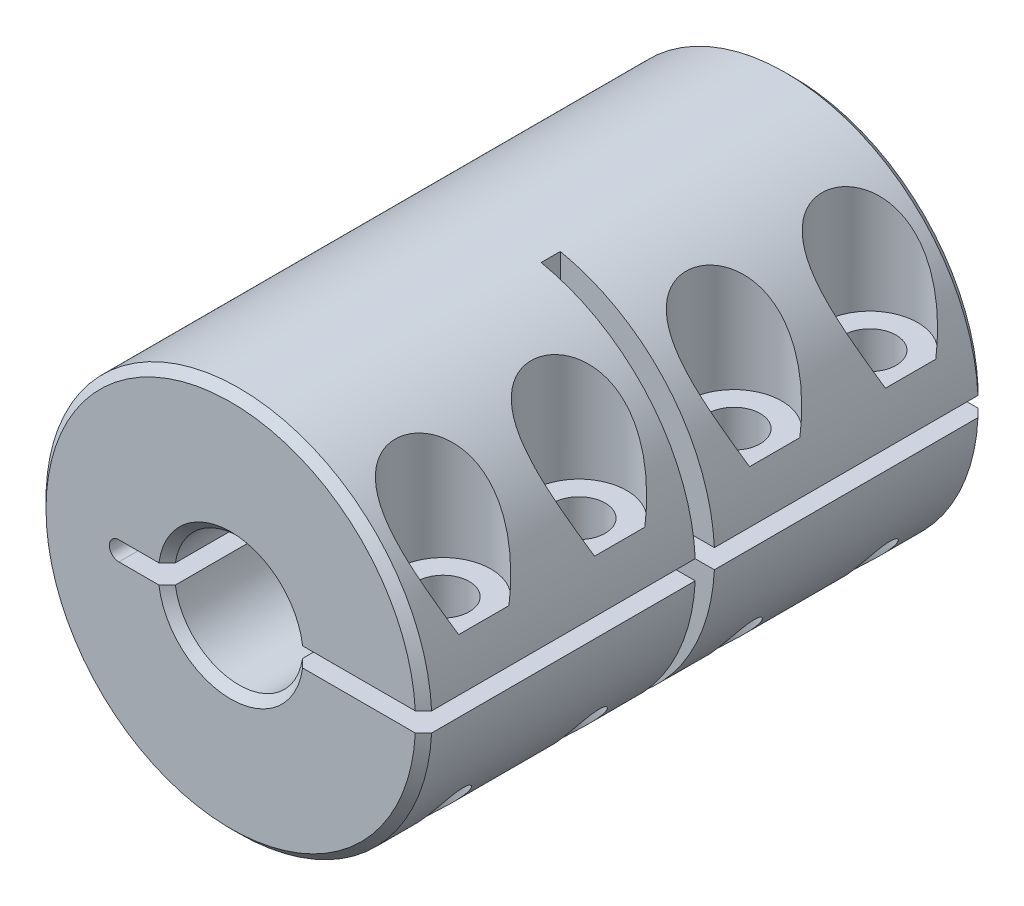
ISO-10303-21;
HEADER;
FILE_DESCRIPTION(('STEP AP214'),'2;1');
FILE_NAME('part.step','',(''),(''),'','','');
FILE_SCHEMA(('AUTOMOTIVE_DESIGN { 1 0 10303 214 1 1 1 1 }'));
ENDSEC;
DATA;
#1=APPLICATION_CONTEXT('core data for automotive mechanical design processes');
#2=APPLICATION_PROTOCOL_DEFINITION('international standard','automotive_design',2000,#1);
#3=PRODUCT_CONTEXT('',#1,'mechanical');
#4=PRODUCT('Part','Part','',(#3));
#5=PRODUCT_RELATED_PRODUCT_CATEGORY('part','',(#4));
#6=PRODUCT_DEFINITION_FORMATION('','',#4);
#7=PRODUCT_DEFINITION_CONTEXT('part definition',#1,'design');
#8=PRODUCT_DEFINITION('design','',#6,#7);
#9=PRODUCT_DEFINITION_SHAPE('','',#8);
#10=(LENGTH_UNIT() NAMED_UNIT(*) SI_UNIT(.MILLI.,.METRE.));
#11=(NAMED_UNIT(*) PLANE_ANGLE_UNIT() SI_UNIT($,.RADIAN.));
#12=(NAMED_UNIT(*) SI_UNIT($,.STERADIAN.) SOLID_ANGLE_UNIT());
#13=UNCERTAINTY_MEASURE_WITH_UNIT(LENGTH_MEASURE(1.E-05),#10,'distance_accuracy_value','');
#14=(GEOMETRIC_REPRESENTATION_CONTEXT(3) GLOBAL_UNCERTAINTY_ASSIGNED_CONTEXT((#13)) GLOBAL_UNIT_ASSIGNED_CONTEXT((#10,
#11,#12)) REPRESENTATION_CONTEXT('',''));
#15=CARTESIAN_POINT('',(0.,0.,0.));
#16=DIRECTION('',(0.,0.,1.));
#17=DIRECTION('',(1.,0.,0.));
#18=AXIS2_PLACEMENT_3D('',#15,#16,#17);
#19=CARTESIAN_POINT('',(8.9789,-0.595312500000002,13.273828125));
#20=DIRECTION('',(0.,1.,0.));
#21=DIRECTION('',(0.,0.,1.));
#22=AXIS2_PLACEMENT_3D('',#19,#20,#21);
#23=CYLINDRICAL_SURFACE('',#22,1.25);
#24=CARTESIAN_POINT('',(8.9789,-0.595312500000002,13.273828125));
#25=DIRECTION('',(0.,1.,0.));
#26=DIRECTION('',(0.,0.,1.));
#27=AXIS2_PLACEMENT_3D('',#24,#25,#26);
#28=CIRCLE('',#27,1.25);
#29=CARTESIAN_POINT('',(8.9789,-0.595312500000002,14.523828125));
#30=VERTEX_POINT('',#29);
#31=EDGE_CURVE('E11',#30,#30,#28,.T.);
#32=ORIENTED_EDGE('',*,*,#31,.T.);
#33=EDGE_LOOP('',(#32));
#34=FACE_BOUND('',#33,.T.);
#35=CARTESIAN_POINT('',(8.97889999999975,-7.96111517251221,12.023828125));
#36=CARTESIAN_POINT('',(8.88633172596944,-8.06551386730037,12.0238210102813));
#37=CARTESIAN_POINT('',(8.79185168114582,-8.16838229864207,12.0340512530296));
#38=CARTESIAN_POINT('',(8.6020464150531,-8.36801119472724,12.0780322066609));
#39=CARTESIAN_POINT('',(8.50672446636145,-8.4647886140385,12.1117141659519));
#40=CARTESIAN_POINT('',(8.35494929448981,-8.61403621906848,12.1887122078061));
#41=CARTESIAN_POINT('',(8.29727613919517,-8.66955456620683,12.2237313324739));
#42=CARTESIAN_POINT('',(8.18539715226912,-8.77525787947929,12.3055093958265));
#43=CARTESIAN_POINT('',(8.13118732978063,-8.82544903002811,12.3522545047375));
#44=CARTESIAN_POINT('',(8.03884530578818,-8.90955068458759,12.4478056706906));
#45=CARTESIAN_POINT('',(7.99963608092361,-8.94472948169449,12.4944453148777));
#46=CARTESIAN_POINT('',(7.92700311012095,-9.00916046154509,12.595683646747));
#47=CARTESIAN_POINT('',(7.89357286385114,-9.03841930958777,12.6502732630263));
#48=CARTESIAN_POINT('',(7.83938496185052,-9.08543446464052,12.7571237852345));
#49=CARTESIAN_POINT('',(7.81744830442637,-9.10429006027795,12.8082998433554));
#50=CARTESIAN_POINT('',(7.78025349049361,-9.1360964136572,12.9147738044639));
#51=CARTESIAN_POINT('',(7.76499231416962,-9.14904984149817,12.9700698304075));
#52=CARTESIAN_POINT('',(7.74209473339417,-9.16843501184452,13.0836167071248));
#53=CARTESIAN_POINT('',(7.73449315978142,-9.17483696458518,13.141879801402));
#54=CARTESIAN_POINT('',(7.72760504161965,-9.18063958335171,13.259241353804));
#55=CARTESIAN_POINT('',(7.72831649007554,-9.18004193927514,13.318339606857));
#56=CARTESIAN_POINT('',(7.73760644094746,-9.17221211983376,13.43073461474));
#57=CARTESIAN_POINT('',(7.74556183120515,-9.1655054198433,13.4841221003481));
#58=CARTESIAN_POINT('',(7.76797053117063,-9.14652105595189,13.5884681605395));
#59=CARTESIAN_POINT('',(7.78242395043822,-9.13424329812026,13.6394266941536));
#60=CARTESIAN_POINT('',(7.81756048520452,-9.10419100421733,13.7393182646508));
#61=CARTESIAN_POINT('',(7.83842234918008,-9.08625829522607,13.7881400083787));
#62=CARTESIAN_POINT('',(7.88514864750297,-9.04573870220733,13.8812206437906));
#63=CARTESIAN_POINT('',(7.91101549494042,-9.02314957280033,13.9254773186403));
#64=CARTESIAN_POINT('',(7.97806937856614,-8.96399024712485,14.0260427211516));
#65=CARTESIAN_POINT('',(8.02120424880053,-8.92547367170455,14.079914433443));
#66=CARTESIAN_POINT('',(8.11273517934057,-8.8423623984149,14.1775759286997));
#67=CARTESIAN_POINT('',(8.16114206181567,-8.79775514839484,14.2213443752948));
#68=CARTESIAN_POINT('',(8.27858451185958,-8.68755121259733,14.312751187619));
#69=CARTESIAN_POINT('',(8.34892584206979,-8.62006060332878,14.356413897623));
#70=CARTESIAN_POINT('',(8.49177795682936,-8.47937493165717,14.4277789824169));
#71=CARTESIAN_POINT('',(8.56429015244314,-8.4061761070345,14.4554707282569));
#72=CARTESIAN_POINT('',(8.69432097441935,-8.27137735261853,14.4924722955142));
#73=CARTESIAN_POINT('',(8.7518614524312,-8.21048145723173,14.504388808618));
#74=CARTESIAN_POINT('',(8.86612656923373,-8.08695693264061,14.520065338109));
#75=CARTESIAN_POINT('',(8.92285147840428,-8.02432889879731,14.5238281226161));
#76=CARTESIAN_POINT('',(9.0334067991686,-7.89964026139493,14.5238281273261));
#77=CARTESIAN_POINT('',(9.08727390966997,-7.83761143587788,14.5202695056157));
#78=CARTESIAN_POINT('',(9.19336451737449,-7.71289526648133,14.5064541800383));
#79=CARTESIAN_POINT('',(9.24558781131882,-7.65020784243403,14.4961966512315));
#80=CARTESIAN_POINT('',(9.34821456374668,-7.52445898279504,14.4692066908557));
#81=CARTESIAN_POINT('',(9.39861304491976,-7.46139700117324,14.4524578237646));
#82=CARTESIAN_POINT('',(9.49713452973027,-7.33558659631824,14.4125793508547));
#83=CARTESIAN_POINT('',(9.54525850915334,-7.27283804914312,14.3894525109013));
#84=CARTESIAN_POINT('',(9.66014482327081,-7.11999620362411,14.3247878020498));
#85=CARTESIAN_POINT('',(9.7255340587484,-7.03032235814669,14.2796496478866));
#86=CARTESIAN_POINT('',(9.81852661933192,-6.89923350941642,14.2007399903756));
#87=CARTESIAN_POINT('',(9.84864512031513,-6.85615325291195,14.1726069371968));
#88=CARTESIAN_POINT('',(9.90696730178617,-6.77160437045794,14.11225122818));
#89=CARTESIAN_POINT('',(9.93517211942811,-6.73013479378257,14.080031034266));
#90=CARTESIAN_POINT('',(9.99176282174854,-6.645861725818,14.007925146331));
#91=CARTESIAN_POINT('',(10.0199338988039,-6.60327739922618,13.9676095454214));
#92=CARTESIAN_POINT('',(10.0728074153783,-6.52233673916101,13.8808255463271));
#93=CARTESIAN_POINT('',(10.0975122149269,-6.48397753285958,13.8343613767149));
#94=CARTESIAN_POINT('',(10.1369759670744,-6.42205118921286,13.7461810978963));
#95=CARTESIAN_POINT('',(10.1527115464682,-6.39711910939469,13.7058763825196));
#96=CARTESIAN_POINT('',(10.1805035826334,-6.35279706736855,13.6211405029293));
#97=CARTESIAN_POINT('',(10.192567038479,-6.33339656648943,13.5767174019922));
#98=CARTESIAN_POINT('',(10.209811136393,-6.30555036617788,13.4945292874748));
#99=CARTESIAN_POINT('',(10.2159241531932,-6.29563048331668,13.4574664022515));
#100=CARTESIAN_POINT('',(10.2247971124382,-6.28120990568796,13.3819123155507));
#101=CARTESIAN_POINT('',(10.2275604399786,-6.27670374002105,13.3434225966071));
#102=CARTESIAN_POINT('',(10.2294765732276,-6.27358058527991,13.2659941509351));
#103=CARTESIAN_POINT('',(10.2286188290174,-6.27498080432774,13.2270544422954));
#104=CARTESIAN_POINT('',(10.2233573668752,-6.28354895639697,13.1500582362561));
#105=CARTESIAN_POINT('',(10.2189510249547,-6.29072115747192,13.1120024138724));
#106=CARTESIAN_POINT('',(10.2057589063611,-6.31210505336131,13.0301734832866));
#107=CARTESIAN_POINT('',(10.1962633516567,-6.32745392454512,12.986816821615));
#108=CARTESIAN_POINT('',(10.1735977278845,-6.3638328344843,12.9036017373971));
#109=CARTESIAN_POINT('',(10.1604207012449,-6.38487362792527,12.8637501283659));
#110=CARTESIAN_POINT('',(10.1234732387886,-6.44337035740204,12.7675228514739));
#111=CARTESIAN_POINT('',(10.0977916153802,-6.48361265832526,12.7135981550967));
#112=CARTESIAN_POINT('',(10.0417945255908,-6.57001021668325,12.6134806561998));
#113=CARTESIAN_POINT('',(10.0114673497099,-6.61618036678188,12.5673080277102));
#114=CARTESIAN_POINT('',(9.95182654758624,-6.70549214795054,12.487682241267));
#115=CARTESIAN_POINT('',(9.92295777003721,-6.74816297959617,12.4533531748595));
#116=CARTESIAN_POINT('',(9.86309195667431,-6.8353651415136,12.3891629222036));
#117=CARTESIAN_POINT('',(9.83209347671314,-6.87989772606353,12.3593048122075));
#118=CARTESIAN_POINT('',(9.76823916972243,-6.97026328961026,12.3036534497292));
#119=CARTESIAN_POINT('',(9.73538063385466,-7.01609811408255,12.2778663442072));
#120=CARTESIAN_POINT('',(9.66805173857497,-7.10858992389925,12.2301460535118));
#121=CARTESIAN_POINT('',(9.63358097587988,-7.1552471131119,12.2082138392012));
#122=CARTESIAN_POINT('',(9.55117043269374,-7.26507573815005,12.1611902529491));
#123=CARTESIAN_POINT('',(9.50264962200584,-7.3284476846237,12.1375761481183));
#124=CARTESIAN_POINT('',(9.40330113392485,-7.45549718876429,12.0968550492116));
#125=CARTESIAN_POINT('',(9.35247261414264,-7.51917485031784,12.0797504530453));
#126=CARTESIAN_POINT('',(9.2488111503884,-7.64632027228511,12.0521391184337));
#127=CARTESIAN_POINT('',(9.19597860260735,-7.70978807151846,12.0416310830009));
#128=CARTESIAN_POINT('',(9.08862415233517,-7.83605710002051,12.0274772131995));
#129=CARTESIAN_POINT('',(9.03410200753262,-7.89885823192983,12.0238323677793));
#130=CARTESIAN_POINT('',(8.97889999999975,-7.96111517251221,12.023828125));
#131=B_SPLINE_CURVE_WITH_KNOTS('',3,(#35,#36,#37,#38,#39,#40,#41,#42,#43,#44,#45,#46,#47,#48,
#49,#50,#51,#52,#53,#54,#55,#56,#57,#58,#59,#60,#61,#62,#63,#64,#65,#66,#67,#68,#69,#70,#71,#72,
#73,#74,#75,#76,#77,#78,#79,#80,#81,#82,#83,#84,#85,#86,#87,#88,#89,#90,#91,#92,#93,#94,#95,#96,
#97,#98,#99,#100,#101,#102,#103,#104,#105,#106,#107,#108,#109,#110,#111,#112,#113,#114,#115,
#116,#117,#118,#119,#120,#121,#122,#123,#124,#125,#126,#127,#128,#129,#130),.UNSPECIFIED.,.T.,
.F.,(4,2,2,2,2,2,2,2,2,2,2,2,2,2,2,2,2,2,2,2,2,2,2,2,2,2,2,2,2,2,2,2,2,2,2,2,2,2,2,2,2,2,2,2,2,
2,2,4),(0.,0.418333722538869,0.835446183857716,1.09676829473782,1.35778363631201,
1.56806787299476,1.77811401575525,1.95373263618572,2.12927172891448,2.3056055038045,
2.48189670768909,2.64432332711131,2.80675268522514,2.97420266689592,3.14173358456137,
3.37752727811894,3.61381446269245,3.9325235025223,4.25144440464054,4.5048891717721,
4.75824788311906,5.00463747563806,5.25105741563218,5.49810538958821,5.74504639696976,
6.10326333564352,6.28197740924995,6.46058433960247,6.65536207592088,6.85000654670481,
6.99935418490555,7.14841535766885,7.26448929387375,7.3804458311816,7.4967404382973,
7.61312111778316,7.75323208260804,7.89360965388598,8.10846589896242,8.32387289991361,
8.5093446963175,8.6949435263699,8.8808199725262,9.0667431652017,9.31613293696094,
9.56561448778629,9.8150469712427,10.0645153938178),.UNSPECIFIED.);
#132=CARTESIAN_POINT('',(8.97889999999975,-7.96111517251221,12.023828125));
#133=VERTEX_POINT('',#132);
#134=EDGE_CURVE('E253',#133,#133,#131,.T.);
#135=ORIENTED_EDGE('',*,*,#134,.F.);
#136=EDGE_LOOP('',(#135));
#137=FACE_BOUND('',#136,.T.);
#138=ADVANCED_FACE('F17',(#34,#137),#23,.F.);
#139=CARTESIAN_POINT('',(8.9789,-0.595312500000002,4.82148437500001));
#140=DIRECTION('',(0.,1.,0.));
#141=DIRECTION('',(0.,0.,1.));
#142=AXIS2_PLACEMENT_3D('',#139,#140,#141);
#143=CYLINDRICAL_SURFACE('',#142,1.25);
#144=CARTESIAN_POINT('',(8.9789,-0.595312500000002,4.82148437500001));
#145=DIRECTION('',(0.,1.,0.));
#146=DIRECTION('',(0.,0.,1.));
#147=AXIS2_PLACEMENT_3D('',#144,#145,#146);
#148=CIRCLE('',#147,1.25);
#149=CARTESIAN_POINT('',(8.9789,-0.595312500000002,6.07148437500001));
#150=VERTEX_POINT('',#149);
#151=EDGE_CURVE('E32',#150,#150,#148,.T.);
#152=ORIENTED_EDGE('',*,*,#151,.T.);
#153=EDGE_LOOP('',(#152));
#154=FACE_BOUND('',#153,.T.);
#155=CARTESIAN_POINT('',(8.97889999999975,-7.96111517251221,3.57148437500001));
#156=CARTESIAN_POINT('',(8.88633172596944,-8.06551386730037,3.57147726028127));
#157=CARTESIAN_POINT('',(8.79185168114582,-8.16838229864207,3.58170750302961));
#158=CARTESIAN_POINT('',(8.6020464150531,-8.36801119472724,3.62568845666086));
#159=CARTESIAN_POINT('',(8.50672446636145,-8.4647886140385,3.65937041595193));
#160=CARTESIAN_POINT('',(8.35494929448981,-8.61403621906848,3.73636845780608));
#161=CARTESIAN_POINT('',(8.29727613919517,-8.66955456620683,3.77138758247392));
#162=CARTESIAN_POINT('',(8.18539715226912,-8.77525787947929,3.85316564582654));
#163=CARTESIAN_POINT('',(8.13118732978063,-8.82544903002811,3.89991075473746));
#164=CARTESIAN_POINT('',(8.03884530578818,-8.90955068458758,3.9954619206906));
#165=CARTESIAN_POINT('',(7.99963608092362,-8.94472948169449,4.04210156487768));
#166=CARTESIAN_POINT('',(7.92700311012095,-9.00916046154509,4.14333989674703));
#167=CARTESIAN_POINT('',(7.89357286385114,-9.03841930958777,4.19792951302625));
#168=CARTESIAN_POINT('',(7.83938496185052,-9.08543446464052,4.30478003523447));
#169=CARTESIAN_POINT('',(7.81744830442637,-9.10429006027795,4.35595609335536));
#170=CARTESIAN_POINT('',(7.78025349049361,-9.1360964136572,4.46243005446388));
#171=CARTESIAN_POINT('',(7.76499231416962,-9.14904984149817,4.51772608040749));
#172=CARTESIAN_POINT('',(7.74209473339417,-9.16843501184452,4.63127295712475));
#173=CARTESIAN_POINT('',(7.73449315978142,-9.17483696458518,4.68953605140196));
#174=CARTESIAN_POINT('',(7.72760504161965,-9.18063958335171,4.80689760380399));
#175=CARTESIAN_POINT('',(7.72831649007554,-9.18004193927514,4.86599585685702));
#176=CARTESIAN_POINT('',(7.73760644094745,-9.17221211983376,4.97839086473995));
#177=CARTESIAN_POINT('',(7.74556183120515,-9.1655054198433,5.03177835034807));
#178=CARTESIAN_POINT('',(7.76797053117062,-9.14652105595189,5.13612441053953));
#179=CARTESIAN_POINT('',(7.78242395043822,-9.13424329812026,5.18708294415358));
#180=CARTESIAN_POINT('',(7.81756048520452,-9.10419100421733,5.28697451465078));
#181=CARTESIAN_POINT('',(7.83842234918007,-9.08625829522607,5.3357962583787));
#182=CARTESIAN_POINT('',(7.88514864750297,-9.04573870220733,5.42887689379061));
#183=CARTESIAN_POINT('',(7.91101549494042,-9.02314957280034,5.47313356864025));
#184=CARTESIAN_POINT('',(7.97806937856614,-8.96399024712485,5.57369897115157));
#185=CARTESIAN_POINT('',(8.02120424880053,-8.92547367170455,5.62757068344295));
#186=CARTESIAN_POINT('',(8.11273517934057,-8.84236239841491,5.72523217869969));
#187=CARTESIAN_POINT('',(8.16114206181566,-8.79775514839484,5.76900062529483));
#188=CARTESIAN_POINT('',(8.27858451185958,-8.68755121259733,5.86040743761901));
#189=CARTESIAN_POINT('',(8.34892584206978,-8.62006060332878,5.90407014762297));
#190=CARTESIAN_POINT('',(8.49177795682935,-8.47937493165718,5.97543523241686));
#191=CARTESIAN_POINT('',(8.56429015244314,-8.4061761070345,6.0031269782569));
#192=CARTESIAN_POINT('',(8.69432097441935,-8.27137735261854,6.04012854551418));
#193=CARTESIAN_POINT('',(8.7518614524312,-8.21048145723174,6.05204505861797));
#194=CARTESIAN_POINT('',(8.86612656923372,-8.08695693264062,6.06772158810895));
#195=CARTESIAN_POINT('',(8.92285147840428,-8.02432889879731,6.07148437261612));
#196=CARTESIAN_POINT('',(9.0334067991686,-7.89964026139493,6.0714843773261));
#197=CARTESIAN_POINT('',(9.08727390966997,-7.83761143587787,6.06792575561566));
#198=CARTESIAN_POINT('',(9.19336451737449,-7.71289526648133,6.05411043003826));
#199=CARTESIAN_POINT('',(9.24558781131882,-7.65020784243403,6.04385290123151));
#200=CARTESIAN_POINT('',(9.34821456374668,-7.52445898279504,6.01686294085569));
#201=CARTESIAN_POINT('',(9.39861304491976,-7.46139700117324,6.00011407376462));
#202=CARTESIAN_POINT('',(9.49713452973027,-7.33558659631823,5.96023560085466));
#203=CARTESIAN_POINT('',(9.54525850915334,-7.27283804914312,5.9371087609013));
#204=CARTESIAN_POINT('',(9.66014482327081,-7.11999620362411,5.87244405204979));
#205=CARTESIAN_POINT('',(9.7255340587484,-7.03032235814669,5.82730589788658));
#206=CARTESIAN_POINT('',(9.81852661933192,-6.89923350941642,5.74839624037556));
#207=CARTESIAN_POINT('',(9.84864512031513,-6.85615325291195,5.72026318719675));
#208=CARTESIAN_POINT('',(9.90696730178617,-6.77160437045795,5.65990747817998));
#209=CARTESIAN_POINT('',(9.93517211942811,-6.73013479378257,5.62768728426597));
#210=CARTESIAN_POINT('',(9.99176282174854,-6.645861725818,5.555581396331));
#211=CARTESIAN_POINT('',(10.0199338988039,-6.60327739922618,5.51526579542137));
#212=CARTESIAN_POINT('',(10.0728074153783,-6.52233673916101,5.42848179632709));
#213=CARTESIAN_POINT('',(10.0975122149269,-6.48397753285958,5.38201762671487));
#214=CARTESIAN_POINT('',(10.1369759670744,-6.42205118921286,5.29383734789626));
#215=CARTESIAN_POINT('',(10.1527115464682,-6.39711910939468,5.25353263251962));
#216=CARTESIAN_POINT('',(10.1805035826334,-6.35279706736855,5.16879675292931));
#217=CARTESIAN_POINT('',(10.192567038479,-6.33339656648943,5.1243736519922));
#218=CARTESIAN_POINT('',(10.209811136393,-6.30555036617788,5.04218553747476));
#219=CARTESIAN_POINT('',(10.2159241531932,-6.29563048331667,5.00512265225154));
#220=CARTESIAN_POINT('',(10.2247971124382,-6.28120990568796,4.92956856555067));
#221=CARTESIAN_POINT('',(10.2275604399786,-6.27670374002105,4.89107884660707));
#222=CARTESIAN_POINT('',(10.2294765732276,-6.27358058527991,4.81365040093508));
#223=CARTESIAN_POINT('',(10.2286188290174,-6.27498080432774,4.77471069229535));
#224=CARTESIAN_POINT('',(10.2233573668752,-6.28354895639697,4.69771448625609));
#225=CARTESIAN_POINT('',(10.2189510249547,-6.29072115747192,4.65965866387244));
#226=CARTESIAN_POINT('',(10.2057589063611,-6.31210505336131,4.57782973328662));
#227=CARTESIAN_POINT('',(10.1962633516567,-6.32745392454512,4.53447307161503));
#228=CARTESIAN_POINT('',(10.1735977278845,-6.3638328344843,4.45125798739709));
#229=CARTESIAN_POINT('',(10.1604207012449,-6.38487362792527,4.41140637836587));
#230=CARTESIAN_POINT('',(10.1234732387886,-6.44337035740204,4.3151791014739));
#231=CARTESIAN_POINT('',(10.0977916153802,-6.48361265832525,4.26125440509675));
#232=CARTESIAN_POINT('',(10.0417945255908,-6.57001021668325,4.16113690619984));
#233=CARTESIAN_POINT('',(10.0114673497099,-6.61618036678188,4.11496427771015));
#234=CARTESIAN_POINT('',(9.95182654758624,-6.70549214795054,4.03533849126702));
#235=CARTESIAN_POINT('',(9.92295777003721,-6.74816297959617,4.00100942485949));
#236=CARTESIAN_POINT('',(9.86309195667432,-6.83536514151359,3.93681917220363));
#237=CARTESIAN_POINT('',(9.83209347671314,-6.87989772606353,3.90696106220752));
#238=CARTESIAN_POINT('',(9.76823916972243,-6.97026328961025,3.85130969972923));
#239=CARTESIAN_POINT('',(9.73538063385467,-7.01609811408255,3.82552259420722));
#240=CARTESIAN_POINT('',(9.66805173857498,-7.10858992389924,3.77780230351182));
#241=CARTESIAN_POINT('',(9.63358097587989,-7.15524711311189,3.75587008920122));
#242=CARTESIAN_POINT('',(9.55117043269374,-7.26507573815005,3.70884650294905));
#243=CARTESIAN_POINT('',(9.50264962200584,-7.3284476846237,3.68523239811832));
#244=CARTESIAN_POINT('',(9.40330113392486,-7.45549718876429,3.64451129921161));
#245=CARTESIAN_POINT('',(9.35247261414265,-7.51917485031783,3.62740670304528));
#246=CARTESIAN_POINT('',(9.24881115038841,-7.64632027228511,3.59979536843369));
#247=CARTESIAN_POINT('',(9.19597860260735,-7.70978807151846,3.58928733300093));
#248=CARTESIAN_POINT('',(9.08862415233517,-7.8360571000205,3.57513346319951));
#249=CARTESIAN_POINT('',(9.03410200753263,-7.89885823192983,3.57148861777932));
#250=CARTESIAN_POINT('',(8.97889999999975,-7.96111517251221,3.57148437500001));
#251=B_SPLINE_CURVE_WITH_KNOTS('',3,(#155,#156,#157,#158,#159,#160,#161,#162,#163,#164,#165,
#166,#167,#168,#169,#170,#171,#172,#173,#174,#175,#176,#177,#178,#179,#180,#181,#182,#183,#184,
#185,#186,#187,#188,#189,#190,#191,#192,#193,#194,#195,#196,#197,#198,#199,#200,#201,#202,#203,
#204,#205,#206,#207,#208,#209,#210,#211,#212,#213,#214,#215,#216,#217,#218,#219,#220,#221,#222,
#223,#224,#225,#226,#227,#228,#229,#230,#231,#232,#233,#234,#235,#236,#237,#238,#239,#240,#241,
#242,#243,#244,#245,#246,#247,#248,#249,#250),.UNSPECIFIED.,.T.,.F.,(4,2,2,2,2,2,2,2,2,2,2,2,2,
2,2,2,2,2,2,2,2,2,2,2,2,2,2,2,2,2,2,2,2,2,2,2,2,2,2,2,2,2,2,2,2,2,2,4),(0.,0.418333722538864,
0.835446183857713,1.09676829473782,1.35778363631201,1.56806787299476,1.77811401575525,
1.95373263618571,2.12927172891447,2.3056055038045,2.48189670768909,2.64432332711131,
2.80675268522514,2.97420266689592,3.14173358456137,3.37752727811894,3.61381446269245,
3.93252350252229,4.25144440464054,4.5048891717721,4.75824788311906,5.00463747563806,
5.25105741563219,5.49810538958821,5.74504639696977,6.10326333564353,6.28197740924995,
6.46058433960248,6.65536207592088,6.85000654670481,6.99935418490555,7.14841535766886,
7.26448929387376,7.38044583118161,7.49674043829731,7.61312111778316,7.75323208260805,
7.89360965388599,8.10846589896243,8.32387289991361,8.5093446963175,8.69494352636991,
8.8808199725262,9.0667431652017,9.31613293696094,9.56561448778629,9.8150469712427,
10.0645153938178),.UNSPECIFIED.);
#252=CARTESIAN_POINT('',(8.97889999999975,-7.96111517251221,3.57148437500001));
#253=VERTEX_POINT('',#252);
#254=EDGE_CURVE('E259',#253,#253,#251,.T.);
#255=ORIENTED_EDGE('',*,*,#254,.F.);
#256=EDGE_LOOP('',(#255));
#257=FACE_BOUND('',#256,.T.);
#258=ADVANCED_FACE('F408',(#154,#257),#143,.F.);
#259=CARTESIAN_POINT('',(8.9789,-0.595312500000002,-4.82148437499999));
#260=DIRECTION('',(0.,1.,0.));
#261=DIRECTION('',(0.,0.,1.));
#262=AXIS2_PLACEMENT_3D('',#259,#260,#261);
#263=CYLINDRICAL_SURFACE('',#262,1.25);
#264=CARTESIAN_POINT('',(8.9789,-0.595312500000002,-4.82148437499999));
#265=DIRECTION('',(0.,1.,0.));
#266=DIRECTION('',(0.,0.,1.));
#267=AXIS2_PLACEMENT_3D('',#264,#265,#266);
#268=CIRCLE('',#267,1.25);
#269=CARTESIAN_POINT('',(8.9789,-0.595312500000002,-3.57148437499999));
#270=VERTEX_POINT('',#269);
#271=EDGE_CURVE('E1165',#270,#270,#268,.T.);
#272=ORIENTED_EDGE('',*,*,#271,.T.);
#273=EDGE_LOOP('',(#272));
#274=FACE_BOUND('',#273,.T.);
#275=CARTESIAN_POINT('',(8.97889999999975,-7.9611151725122,-6.07148437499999));
#276=CARTESIAN_POINT('',(8.88633172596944,-8.06551386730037,-6.07149148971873));
#277=CARTESIAN_POINT('',(8.79185168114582,-8.16838229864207,-6.06126124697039));
#278=CARTESIAN_POINT('',(8.6020464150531,-8.36801119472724,-6.01728029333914));
#279=CARTESIAN_POINT('',(8.50672446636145,-8.4647886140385,-5.98359833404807));
#280=CARTESIAN_POINT('',(8.35494929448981,-8.61403621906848,-5.90660029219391));
#281=CARTESIAN_POINT('',(8.29727613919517,-8.66955456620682,-5.87158116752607));
#282=CARTESIAN_POINT('',(8.18539715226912,-8.77525787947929,-5.78980310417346));
#283=CARTESIAN_POINT('',(8.13118732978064,-8.82544903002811,-5.74305799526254));
#284=CARTESIAN_POINT('',(8.03884530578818,-8.90955068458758,-5.64750682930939));
#285=CARTESIAN_POINT('',(7.99963608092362,-8.94472948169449,-5.60086718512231));
#286=CARTESIAN_POINT('',(7.92700311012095,-9.00916046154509,-5.49962885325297));
#287=CARTESIAN_POINT('',(7.89357286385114,-9.03841930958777,-5.44503923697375));
#288=CARTESIAN_POINT('',(7.83938496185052,-9.08543446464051,-5.33818871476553));
#289=CARTESIAN_POINT('',(7.81744830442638,-9.10429006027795,-5.28701265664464));
#290=CARTESIAN_POINT('',(7.78025349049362,-9.1360964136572,-5.18053869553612));
#291=CARTESIAN_POINT('',(7.76499231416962,-9.14904984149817,-5.12524266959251));
#292=CARTESIAN_POINT('',(7.74209473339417,-9.16843501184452,-5.01169579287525));
#293=CARTESIAN_POINT('',(7.73449315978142,-9.17483696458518,-4.95343269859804));
#294=CARTESIAN_POINT('',(7.72760504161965,-9.18063958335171,-4.83607114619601));
#295=CARTESIAN_POINT('',(7.72831649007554,-9.18004193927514,-4.77697289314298));
#296=CARTESIAN_POINT('',(7.73760644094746,-9.17221211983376,-4.66457788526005));
#297=CARTESIAN_POINT('',(7.74556183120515,-9.1655054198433,-4.61119039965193));
#298=CARTESIAN_POINT('',(7.76797053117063,-9.14652105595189,-4.50684433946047));
#299=CARTESIAN_POINT('',(7.78242395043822,-9.13424329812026,-4.45588580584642));
#300=CARTESIAN_POINT('',(7.81756048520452,-9.10419100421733,-4.35599423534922));
#301=CARTESIAN_POINT('',(7.83842234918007,-9.08625829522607,-4.30717249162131));
#302=CARTESIAN_POINT('',(7.88514864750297,-9.04573870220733,-4.21409185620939));
#303=CARTESIAN_POINT('',(7.91101549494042,-9.02314957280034,-4.16983518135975));
#304=CARTESIAN_POINT('',(7.97806937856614,-8.96399024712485,-4.06926977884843));
#305=CARTESIAN_POINT('',(8.02120424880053,-8.92547367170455,-4.01539806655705));
#306=CARTESIAN_POINT('',(8.11273517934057,-8.84236239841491,-3.91773657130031));
#307=CARTESIAN_POINT('',(8.16114206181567,-8.79775514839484,-3.87396812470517));
#308=CARTESIAN_POINT('',(8.27858451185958,-8.68755121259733,-3.78256131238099));
#309=CARTESIAN_POINT('',(8.34892584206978,-8.62006060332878,-3.73889860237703));
#310=CARTESIAN_POINT('',(8.49177795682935,-8.47937493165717,-3.66753351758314));
#311=CARTESIAN_POINT('',(8.56429015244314,-8.4061761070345,-3.6398417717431));
#312=CARTESIAN_POINT('',(8.69432097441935,-8.27137735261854,-3.60284020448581));
#313=CARTESIAN_POINT('',(8.7518614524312,-8.21048145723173,-3.59092369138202));
#314=CARTESIAN_POINT('',(8.86612656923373,-8.08695693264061,-3.57524716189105));
#315=CARTESIAN_POINT('',(8.92285147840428,-8.02432889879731,-3.57148437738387));
#316=CARTESIAN_POINT('',(9.0334067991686,-7.89964026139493,-3.5714843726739));
#317=CARTESIAN_POINT('',(9.08727390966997,-7.83761143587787,-3.57504299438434));
#318=CARTESIAN_POINT('',(9.19336451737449,-7.71289526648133,-3.58885831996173));
#319=CARTESIAN_POINT('',(9.24558781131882,-7.65020784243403,-3.59911584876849));
#320=CARTESIAN_POINT('',(9.34821456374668,-7.52445898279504,-3.6261058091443));
#321=CARTESIAN_POINT('',(9.39861304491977,-7.46139700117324,-3.64285467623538));
#322=CARTESIAN_POINT('',(9.49713452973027,-7.33558659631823,-3.68273314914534));
#323=CARTESIAN_POINT('',(9.54525850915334,-7.27283804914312,-3.70585998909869));
#324=CARTESIAN_POINT('',(9.66014482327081,-7.11999620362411,-3.77052469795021));
#325=CARTESIAN_POINT('',(9.7255340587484,-7.03032235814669,-3.81566285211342));
#326=CARTESIAN_POINT('',(9.81852661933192,-6.89923350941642,-3.89457250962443));
#327=CARTESIAN_POINT('',(9.84864512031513,-6.85615325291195,-3.92270556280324));
#328=CARTESIAN_POINT('',(9.90696730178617,-6.77160437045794,-3.98306127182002));
#329=CARTESIAN_POINT('',(9.93517211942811,-6.73013479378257,-4.01528146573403));
#330=CARTESIAN_POINT('',(9.99176282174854,-6.645861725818,-4.08738735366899));
#331=CARTESIAN_POINT('',(10.0199338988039,-6.60327739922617,-4.12770295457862));
#332=CARTESIAN_POINT('',(10.0728074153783,-6.52233673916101,-4.21448695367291));
#333=CARTESIAN_POINT('',(10.0975122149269,-6.48397753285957,-4.26095112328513));
#334=CARTESIAN_POINT('',(10.1369759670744,-6.42205118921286,-4.34913140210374));
#335=CARTESIAN_POINT('',(10.1527115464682,-6.39711910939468,-4.38943611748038));
#336=CARTESIAN_POINT('',(10.1805035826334,-6.35279706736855,-4.47417199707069));
#337=CARTESIAN_POINT('',(10.192567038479,-6.33339656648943,-4.5185950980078));
#338=CARTESIAN_POINT('',(10.209811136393,-6.30555036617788,-4.60078321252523));
#339=CARTESIAN_POINT('',(10.2159241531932,-6.29563048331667,-4.63784609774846));
#340=CARTESIAN_POINT('',(10.2247971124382,-6.28120990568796,-4.71340018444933));
#341=CARTESIAN_POINT('',(10.2275604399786,-6.27670374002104,-4.75188990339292));
#342=CARTESIAN_POINT('',(10.2294765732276,-6.2735805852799,-4.82931834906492));
#343=CARTESIAN_POINT('',(10.2286188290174,-6.27498080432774,-4.86825805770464));
#344=CARTESIAN_POINT('',(10.2233573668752,-6.28354895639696,-4.9452542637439));
#345=CARTESIAN_POINT('',(10.2189510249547,-6.29072115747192,-4.98331008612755));
#346=CARTESIAN_POINT('',(10.2057589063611,-6.3121050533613,-5.06513901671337));
#347=CARTESIAN_POINT('',(10.1962633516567,-6.32745392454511,-5.10849567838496));
#348=CARTESIAN_POINT('',(10.1735977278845,-6.36383283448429,-5.1917107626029));
#349=CARTESIAN_POINT('',(10.1604207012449,-6.38487362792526,-5.23156237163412));
#350=CARTESIAN_POINT('',(10.1234732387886,-6.44337035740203,-5.32778964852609));
#351=CARTESIAN_POINT('',(10.0977916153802,-6.48361265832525,-5.38171434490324));
#352=CARTESIAN_POINT('',(10.0417945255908,-6.57001021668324,-5.48183184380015));
#353=CARTESIAN_POINT('',(10.0114673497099,-6.61618036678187,-5.52800447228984));
#354=CARTESIAN_POINT('',(9.95182654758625,-6.70549214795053,-5.60763025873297));
#355=CARTESIAN_POINT('',(9.92295777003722,-6.74816297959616,-5.6419593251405));
#356=CARTESIAN_POINT('',(9.86309195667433,-6.83536514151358,-5.70614957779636));
#357=CARTESIAN_POINT('',(9.83209347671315,-6.87989772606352,-5.73600768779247));
#358=CARTESIAN_POINT('',(9.76823916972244,-6.97026328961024,-5.79165905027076));
#359=CARTESIAN_POINT('',(9.73538063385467,-7.01609811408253,-5.81744615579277));
#360=CARTESIAN_POINT('',(9.66805173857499,-7.10858992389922,-5.86516644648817));
#361=CARTESIAN_POINT('',(9.6335809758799,-7.15524711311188,-5.88709866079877));
#362=CARTESIAN_POINT('',(9.55117043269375,-7.26507573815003,-5.93412224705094));
#363=CARTESIAN_POINT('',(9.50264962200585,-7.32844768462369,-5.95773635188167));
#364=CARTESIAN_POINT('',(9.40330113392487,-7.45549718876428,-5.99845745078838));
#365=CARTESIAN_POINT('',(9.35247261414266,-7.51917485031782,-6.01556204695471));
#366=CARTESIAN_POINT('',(9.24881115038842,-7.6463202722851,-6.04317338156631));
#367=CARTESIAN_POINT('',(9.19597860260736,-7.70978807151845,-6.05368141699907));
#368=CARTESIAN_POINT('',(9.08862415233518,-7.8360571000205,-6.06783528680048));
#369=CARTESIAN_POINT('',(9.03410200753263,-7.89885823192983,-6.07148013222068));
#370=CARTESIAN_POINT('',(8.97889999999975,-7.9611151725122,-6.07148437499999));
#371=B_SPLINE_CURVE_WITH_KNOTS('',3,(#275,#276,#277,#278,#279,#280,#281,#282,#283,#284,#285,
#286,#287,#288,#289,#290,#291,#292,#293,#294,#295,#296,#297,#298,#299,#300,#301,#302,#303,#304,
#305,#306,#307,#308,#309,#310,#311,#312,#313,#314,#315,#316,#317,#318,#319,#320,#321,#322,#323,
#324,#325,#326,#327,#328,#329,#330,#331,#332,#333,#334,#335,#336,#337,#338,#339,#340,#341,#342,
#343,#344,#345,#346,#347,#348,#349,#350,#351,#352,#353,#354,#355,#356,#357,#358,#359,#360,#361,
#362,#363,#364,#365,#366,#367,#368,#369,#370),.UNSPECIFIED.,.T.,.F.,(4,2,2,2,2,2,2,2,2,2,2,2,2,
2,2,2,2,2,2,2,2,2,2,2,2,2,2,2,2,2,2,2,2,2,2,2,2,2,2,2,2,2,2,2,2,2,2,4),(0.,0.418333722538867,
0.835446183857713,1.09676829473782,1.35778363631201,1.56806787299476,1.77811401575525,
1.95373263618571,2.12927172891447,2.3056055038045,2.48189670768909,2.64432332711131,
2.80675268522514,2.97420266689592,3.14173358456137,3.37752727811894,3.61381446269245,
3.9325235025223,4.25144440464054,4.5048891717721,4.75824788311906,5.00463747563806,
5.25105741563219,5.49810538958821,5.74504639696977,6.10326333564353,6.28197740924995,
6.46058433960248,6.65536207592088,6.85000654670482,6.99935418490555,7.14841535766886,
7.26448929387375,7.3804458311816,7.49674043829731,7.61312111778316,7.75323208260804,
7.89360965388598,8.10846589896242,8.3238728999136,8.50934469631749,8.6949435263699,
8.88081997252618,9.06674316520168,9.31613293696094,9.56561448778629,9.8150469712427,
10.0645153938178),.UNSPECIFIED.);
#372=CARTESIAN_POINT('',(8.97889999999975,-7.9611151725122,-6.07148437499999));
#373=VERTEX_POINT('',#372);
#374=EDGE_CURVE('E295',#373,#373,#371,.T.);
#375=ORIENTED_EDGE('',*,*,#374,.F.);
#376=EDGE_LOOP('',(#375));
#377=FACE_BOUND('',#376,.T.);
#378=ADVANCED_FACE('F414',(#274,#377),#263,.F.);
#379=CARTESIAN_POINT('',(8.9789,-0.595312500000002,-13.273828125));
#380=DIRECTION('',(0.,1.,0.));
#381=DIRECTION('',(0.,0.,1.));
#382=AXIS2_PLACEMENT_3D('',#379,#380,#381);
#383=CYLINDRICAL_SURFACE('',#382,1.25);
#384=CARTESIAN_POINT('',(8.9789,-0.595312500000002,-13.273828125));
#385=DIRECTION('',(0.,1.,0.));
#386=DIRECTION('',(0.,0.,1.));
#387=AXIS2_PLACEMENT_3D('',#384,#385,#386);
#388=CIRCLE('',#387,1.25);
#389=CARTESIAN_POINT('',(8.9789,-0.595312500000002,-12.023828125));
#390=VERTEX_POINT('',#389);
#391=EDGE_CURVE('E1170',#390,#390,#388,.T.);
#392=ORIENTED_EDGE('',*,*,#391,.T.);
#393=EDGE_LOOP('',(#392));
#394=FACE_BOUND('',#393,.T.);
#395=CARTESIAN_POINT('',(8.97889999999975,-7.9611151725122,-14.523828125));
#396=CARTESIAN_POINT('',(8.88633172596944,-8.06551386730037,-14.5238352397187));
#397=CARTESIAN_POINT('',(8.79185168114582,-8.16838229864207,-14.5136049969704));
#398=CARTESIAN_POINT('',(8.6020464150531,-8.36801119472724,-14.4696240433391));
#399=CARTESIAN_POINT('',(8.50672446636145,-8.4647886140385,-14.4359420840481));
#400=CARTESIAN_POINT('',(8.35494929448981,-8.61403621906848,-14.3589440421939));
#401=CARTESIAN_POINT('',(8.29727613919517,-8.66955456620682,-14.3239249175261));
#402=CARTESIAN_POINT('',(8.18539715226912,-8.77525787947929,-14.2421468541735));
#403=CARTESIAN_POINT('',(8.13118732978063,-8.82544903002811,-14.1954017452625));
#404=CARTESIAN_POINT('',(8.03884530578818,-8.90955068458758,-14.0998505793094));
#405=CARTESIAN_POINT('',(7.99963608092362,-8.94472948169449,-14.0532109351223));
#406=CARTESIAN_POINT('',(7.92700311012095,-9.00916046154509,-13.951972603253));
#407=CARTESIAN_POINT('',(7.89357286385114,-9.03841930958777,-13.8973829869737));
#408=CARTESIAN_POINT('',(7.83938496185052,-9.08543446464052,-13.7905324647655));
#409=CARTESIAN_POINT('',(7.81744830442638,-9.10429006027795,-13.7393564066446));
#410=CARTESIAN_POINT('',(7.78025349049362,-9.1360964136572,-13.6328824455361));
#411=CARTESIAN_POINT('',(7.76499231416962,-9.14904984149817,-13.5775864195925));
#412=CARTESIAN_POINT('',(7.74209473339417,-9.16843501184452,-13.4640395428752));
#413=CARTESIAN_POINT('',(7.73449315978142,-9.17483696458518,-13.405776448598));
#414=CARTESIAN_POINT('',(7.72760504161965,-9.18063958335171,-13.288414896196));
#415=CARTESIAN_POINT('',(7.72831649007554,-9.18004193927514,-13.229316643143));
#416=CARTESIAN_POINT('',(7.73760644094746,-9.17221211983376,-13.11692163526));
#417=CARTESIAN_POINT('',(7.74556183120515,-9.1655054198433,-13.0635341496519));
#418=CARTESIAN_POINT('',(7.76797053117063,-9.14652105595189,-12.9591880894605));
#419=CARTESIAN_POINT('',(7.78242395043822,-9.13424329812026,-12.9082295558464));
#420=CARTESIAN_POINT('',(7.81756048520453,-9.10419100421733,-12.8083379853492));
#421=CARTESIAN_POINT('',(7.83842234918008,-9.08625829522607,-12.7595162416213));
#422=CARTESIAN_POINT('',(7.88514864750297,-9.04573870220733,-12.6664356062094));
#423=CARTESIAN_POINT('',(7.91101549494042,-9.02314957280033,-12.6221789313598));
#424=CARTESIAN_POINT('',(7.97806937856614,-8.96399024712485,-12.5216135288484));
#425=CARTESIAN_POINT('',(8.02120424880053,-8.92547367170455,-12.4677418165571));
#426=CARTESIAN_POINT('',(8.11273517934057,-8.8423623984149,-12.3700803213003));
#427=CARTESIAN_POINT('',(8.16114206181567,-8.79775514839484,-12.3263118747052));
#428=CARTESIAN_POINT('',(8.27858451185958,-8.68755121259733,-12.234905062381));
#429=CARTESIAN_POINT('',(8.34892584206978,-8.62006060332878,-12.191242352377));
#430=CARTESIAN_POINT('',(8.49177795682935,-8.47937493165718,-12.1198772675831));
#431=CARTESIAN_POINT('',(8.56429015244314,-8.4061761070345,-12.0921855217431));
#432=CARTESIAN_POINT('',(8.69432097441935,-8.27137735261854,-12.0551839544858));
#433=CARTESIAN_POINT('',(8.7518614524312,-8.21048145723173,-12.043267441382));
#434=CARTESIAN_POINT('',(8.86612656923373,-8.08695693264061,-12.0275909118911));
#435=CARTESIAN_POINT('',(8.92285147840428,-8.02432889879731,-12.0238281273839));
#436=CARTESIAN_POINT('',(9.03340679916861,-7.89964026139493,-12.0238281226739));
#437=CARTESIAN_POINT('',(9.08727390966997,-7.83761143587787,-12.0273867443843));
#438=CARTESIAN_POINT('',(9.1933645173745,-7.71289526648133,-12.0412020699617));
#439=CARTESIAN_POINT('',(9.24558781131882,-7.65020784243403,-12.0514595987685));
#440=CARTESIAN_POINT('',(9.34821456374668,-7.52445898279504,-12.0784495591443));
#441=CARTESIAN_POINT('',(9.39861304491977,-7.46139700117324,-12.0951984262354));
#442=CARTESIAN_POINT('',(9.49713452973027,-7.33558659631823,-12.1350768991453));
#443=CARTESIAN_POINT('',(9.54525850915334,-7.27283804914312,-12.1582037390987));
#444=CARTESIAN_POINT('',(9.66014482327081,-7.11999620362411,-12.2228684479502));
#445=CARTESIAN_POINT('',(9.7255340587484,-7.03032235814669,-12.2680066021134));
#446=CARTESIAN_POINT('',(9.81852661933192,-6.89923350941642,-12.3469162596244));
#447=CARTESIAN_POINT('',(9.84864512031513,-6.85615325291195,-12.3750493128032));
#448=CARTESIAN_POINT('',(9.90696730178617,-6.77160437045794,-12.43540502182));
#449=CARTESIAN_POINT('',(9.93517211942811,-6.73013479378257,-12.467625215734));
#450=CARTESIAN_POINT('',(9.99176282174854,-6.645861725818,-12.539731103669));
#451=CARTESIAN_POINT('',(10.0199338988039,-6.60327739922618,-12.5800467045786));
#452=CARTESIAN_POINT('',(10.0728074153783,-6.52233673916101,-12.6668307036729));
#453=CARTESIAN_POINT('',(10.0975122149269,-6.48397753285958,-12.7132948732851));
#454=CARTESIAN_POINT('',(10.1369759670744,-6.42205118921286,-12.8014751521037));
#455=CARTESIAN_POINT('',(10.1527115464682,-6.39711910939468,-12.8417798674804));
#456=CARTESIAN_POINT('',(10.1805035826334,-6.35279706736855,-12.9265157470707));
#457=CARTESIAN_POINT('',(10.192567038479,-6.33339656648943,-12.9709388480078));
#458=CARTESIAN_POINT('',(10.209811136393,-6.30555036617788,-13.0531269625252));
#459=CARTESIAN_POINT('',(10.2159241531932,-6.29563048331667,-13.0901898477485));
#460=CARTESIAN_POINT('',(10.2247971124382,-6.28120990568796,-13.1657439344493));
#461=CARTESIAN_POINT('',(10.2275604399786,-6.27670374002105,-13.2042336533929));
#462=CARTESIAN_POINT('',(10.2294765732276,-6.2735805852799,-13.2816620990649));
#463=CARTESIAN_POINT('',(10.2286188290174,-6.27498080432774,-13.3206018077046));
#464=CARTESIAN_POINT('',(10.2233573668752,-6.28354895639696,-13.3975980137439));
#465=CARTESIAN_POINT('',(10.2189510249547,-6.29072115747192,-13.4356538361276));
#466=CARTESIAN_POINT('',(10.2057589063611,-6.31210505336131,-13.5174827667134));
#467=CARTESIAN_POINT('',(10.1962633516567,-6.32745392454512,-13.560839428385));
#468=CARTESIAN_POINT('',(10.1735977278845,-6.3638328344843,-13.6440545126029));
#469=CARTESIAN_POINT('',(10.1604207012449,-6.38487362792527,-13.6839061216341));
#470=CARTESIAN_POINT('',(10.1234732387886,-6.44337035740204,-13.7801333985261));
#471=CARTESIAN_POINT('',(10.0977916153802,-6.48361265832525,-13.8340580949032));
#472=CARTESIAN_POINT('',(10.0417945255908,-6.57001021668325,-13.9341755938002));
#473=CARTESIAN_POINT('',(10.0114673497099,-6.61618036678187,-13.9803482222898));
#474=CARTESIAN_POINT('',(9.95182654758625,-6.70549214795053,-14.059974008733));
#475=CARTESIAN_POINT('',(9.92295777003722,-6.74816297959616,-14.0943030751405));
#476=CARTESIAN_POINT('',(9.86309195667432,-6.83536514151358,-14.1584933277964));
#477=CARTESIAN_POINT('',(9.83209347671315,-6.87989772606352,-14.1883514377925));
#478=CARTESIAN_POINT('',(9.76823916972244,-6.97026328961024,-14.2440028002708));
#479=CARTESIAN_POINT('',(9.73538063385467,-7.01609811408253,-14.2697899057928));
#480=CARTESIAN_POINT('',(9.66805173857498,-7.10858992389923,-14.3175101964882));
#481=CARTESIAN_POINT('',(9.63358097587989,-7.15524711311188,-14.3394424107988));
#482=CARTESIAN_POINT('',(9.55117043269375,-7.26507573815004,-14.3864659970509));
#483=CARTESIAN_POINT('',(9.50264962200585,-7.32844768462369,-14.4100801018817));
#484=CARTESIAN_POINT('',(9.40330113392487,-7.45549718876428,-14.4508012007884));
#485=CARTESIAN_POINT('',(9.35247261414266,-7.51917485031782,-14.4679057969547));
#486=CARTESIAN_POINT('',(9.24881115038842,-7.6463202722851,-14.4955171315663));
#487=CARTESIAN_POINT('',(9.19597860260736,-7.70978807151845,-14.5060251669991));
#488=CARTESIAN_POINT('',(9.08862415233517,-7.8360571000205,-14.5201790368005));
#489=CARTESIAN_POINT('',(9.03410200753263,-7.89885823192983,-14.5238238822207));
#490=CARTESIAN_POINT('',(8.97889999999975,-7.9611151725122,-14.523828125));
#491=B_SPLINE_CURVE_WITH_KNOTS('',3,(#395,#396,#397,#398,#399,#400,#401,#402,#403,#404,#405,
#406,#407,#408,#409,#410,#411,#412,#413,#414,#415,#416,#417,#418,#419,#420,#421,#422,#423,#424,
#425,#426,#427,#428,#429,#430,#431,#432,#433,#434,#435,#436,#437,#438,#439,#440,#441,#442,#443,
#444,#445,#446,#447,#448,#449,#450,#451,#452,#453,#454,#455,#456,#457,#458,#459,#460,#461,#462,
#463,#464,#465,#466,#467,#468,#469,#470,#471,#472,#473,#474,#475,#476,#477,#478,#479,#480,#481,
#482,#483,#484,#485,#486,#487,#488,#489,#490),.UNSPECIFIED.,.T.,.F.,(4,2,2,2,2,2,2,2,2,2,2,2,2,
2,2,2,2,2,2,2,2,2,2,2,2,2,2,2,2,2,2,2,2,2,2,2,2,2,2,2,2,2,2,2,2,2,2,4),(0.,0.418333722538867,
0.835446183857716,1.09676829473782,1.35778363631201,1.56806787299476,1.77811401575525,
1.95373263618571,2.12927172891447,2.3056055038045,2.48189670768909,2.64432332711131,
2.80675268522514,2.97420266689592,3.14173358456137,3.37752727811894,3.61381446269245,
3.93252350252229,4.25144440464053,4.5048891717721,4.75824788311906,5.00463747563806,
5.25105741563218,5.49810538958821,5.74504639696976,6.10326333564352,6.28197740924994,
6.46058433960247,6.65536207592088,6.85000654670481,6.99935418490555,7.14841535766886,
7.26448929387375,7.3804458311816,7.4967404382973,7.61312111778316,7.75323208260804,
7.89360965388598,8.10846589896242,8.3238728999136,8.50934469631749,8.69494352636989,
8.88081997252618,9.06674316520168,9.31613293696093,9.56561448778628,9.81504697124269,
10.0645153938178),.UNSPECIFIED.);
#492=CARTESIAN_POINT('',(8.97889999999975,-7.9611151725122,-14.523828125));
#493=VERTEX_POINT('',#492);
#494=EDGE_CURVE('E297',#493,#493,#491,.T.);
#495=ORIENTED_EDGE('',*,*,#494,.F.);
#496=EDGE_LOOP('',(#495));
#497=FACE_BOUND('',#496,.T.);
#498=ADVANCED_FACE('F1052',(#394,#497),#383,.F.);
#499=CARTESIAN_POINT('',(8.9789,-12.001,-13.273828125));
#500=DIRECTION('',(0.,1.,0.));
#501=DIRECTION('',(-1.,0.,0.));
#502=AXIS2_PLACEMENT_3D('',#499,#500,#501);
#503=CYLINDRICAL_SURFACE('',#502,1.63195);
#504=CARTESIAN_POINT('',(8.9789,3.389,-13.273828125));
#505=DIRECTION('',(0.,1.,0.));
#506=DIRECTION('',(-1.,0.,0.));
#507=AXIS2_PLACEMENT_3D('',#504,#505,#506);
#508=CIRCLE('',#507,1.63195);
#509=CARTESIAN_POINT('',(7.34695,3.389,-13.273828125));
#510=VERTEX_POINT('',#509);
#511=EDGE_CURVE('E1180',#510,#510,#508,.T.);
#512=ORIENTED_EDGE('',*,*,#511,.T.);
#513=EDGE_LOOP('',(#512));
#514=FACE_BOUND('',#513,.T.);
#515=CARTESIAN_POINT('',(8.9789,0.595312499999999,-13.273828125));
#516=DIRECTION('',(0.,-1.,0.));
#517=DIRECTION('',(-1.,0.,0.));
#518=AXIS2_PLACEMENT_3D('',#515,#516,#517);
#519=CIRCLE('',#518,1.63195);
#520=CARTESIAN_POINT('',(7.34695,0.595312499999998,-13.273828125));
#521=VERTEX_POINT('',#520);
#522=EDGE_CURVE('E1171',#521,#521,#519,.T.);
#523=ORIENTED_EDGE('',*,*,#522,.T.);
#524=EDGE_LOOP('',(#523));
#525=FACE_BOUND('',#524,.T.);
#526=ADVANCED_FACE('F1042',(#514,#525),#503,.F.);
#527=CARTESIAN_POINT('',(8.9789,-12.001,-4.82148437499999));
#528=DIRECTION('',(0.,1.,0.));
#529=DIRECTION('',(-1.,0.,0.));
#530=AXIS2_PLACEMENT_3D('',#527,#528,#529);
#531=CYLINDRICAL_SURFACE('',#530,1.63195);
#532=CARTESIAN_POINT('',(8.9789,3.389,-4.82148437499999));
#533=DIRECTION('',(0.,1.,0.));
#534=DIRECTION('',(-1.,0.,0.));
#535=AXIS2_PLACEMENT_3D('',#532,#533,#534);
#536=CIRCLE('',#535,1.63195);
#537=CARTESIAN_POINT('',(7.34695,3.389,-4.82148437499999));
#538=VERTEX_POINT('',#537);
#539=EDGE_CURVE('E1181',#538,#538,#536,.T.);
#540=ORIENTED_EDGE('',*,*,#539,.T.);
#541=EDGE_LOOP('',(#540));
#542=FACE_BOUND('',#541,.T.);
#543=CARTESIAN_POINT('',(8.9789,0.595312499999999,-4.82148437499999));
#544=DIRECTION('',(0.,-1.,0.));
#545=DIRECTION('',(-1.,0.,0.));
#546=AXIS2_PLACEMENT_3D('',#543,#544,#545);
#547=CIRCLE('',#546,1.63195);
#548=CARTESIAN_POINT('',(7.34695,0.595312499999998,-4.82148437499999));
#549=VERTEX_POINT('',#548);
#550=EDGE_CURVE('E1179',#549,#549,#547,.T.);
#551=ORIENTED_EDGE('',*,*,#550,.T.);
#552=EDGE_LOOP('',(#551));
#553=FACE_BOUND('',#552,.T.);
#554=ADVANCED_FACE('F1032',(#542,#553),#531,.F.);
#555=CARTESIAN_POINT('',(8.9789,-12.001,4.82148437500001));
#556=DIRECTION('',(0.,1.,0.));
#557=DIRECTION('',(-1.,0.,0.));
#558=AXIS2_PLACEMENT_3D('',#555,#556,#557);
#559=CYLINDRICAL_SURFACE('',#558,1.63195);
#560=CARTESIAN_POINT('',(8.9789,3.389,4.82148437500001));
#561=DIRECTION('',(0.,1.,0.));
#562=DIRECTION('',(-1.,0.,0.));
#563=AXIS2_PLACEMENT_3D('',#560,#561,#562);
#564=CIRCLE('',#563,1.63195);
#565=CARTESIAN_POINT('',(7.34695,3.389,4.82148437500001));
#566=VERTEX_POINT('',#565);
#567=EDGE_CURVE('E1190',#566,#566,#564,.T.);
#568=ORIENTED_EDGE('',*,*,#567,.T.);
#569=EDGE_LOOP('',(#568));
#570=FACE_BOUND('',#569,.T.);
#571=CARTESIAN_POINT('',(8.9789,0.595312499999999,4.82148437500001));
#572=DIRECTION('',(0.,-1.,0.));
#573=DIRECTION('',(-1.,0.,0.));
#574=AXIS2_PLACEMENT_3D('',#571,#572,#573);
#575=CIRCLE('',#574,1.63195);
#576=CARTESIAN_POINT('',(7.34695,0.595312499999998,4.82148437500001));
#577=VERTEX_POINT('',#576);
#578=EDGE_CURVE('E1188',#577,#577,#575,.T.);
#579=ORIENTED_EDGE('',*,*,#578,.T.);
#580=EDGE_LOOP('',(#579));
#581=FACE_BOUND('',#580,.T.);
#582=ADVANCED_FACE('F1028',(#570,#581),#559,.F.);
#583=CARTESIAN_POINT('',(8.9789,-12.001,13.273828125));
#584=DIRECTION('',(0.,1.,0.));
#585=DIRECTION('',(-1.,0.,0.));
#586=AXIS2_PLACEMENT_3D('',#583,#584,#585);
#587=CYLINDRICAL_SURFACE('',#586,1.63195);
#588=CARTESIAN_POINT('',(8.9789,3.389,13.273828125));
#589=DIRECTION('',(0.,1.,0.));
#590=DIRECTION('',(-1.,0.,0.));
#591=AXIS2_PLACEMENT_3D('',#588,#589,#590);
#592=CIRCLE('',#591,1.63195);
#593=CARTESIAN_POINT('',(7.34695,3.389,13.273828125));
#594=VERTEX_POINT('',#593);
#595=EDGE_CURVE('E710',#594,#594,#592,.T.);
#596=ORIENTED_EDGE('',*,*,#595,.T.);
#597=EDGE_LOOP('',(#596));
#598=FACE_BOUND('',#597,.T.);
#599=CARTESIAN_POINT('',(8.9789,0.595312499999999,13.273828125));
#600=DIRECTION('',(0.,-1.,0.));
#601=DIRECTION('',(-1.,0.,0.));
#602=AXIS2_PLACEMENT_3D('',#599,#600,#601);
#603=CIRCLE('',#602,1.63195);
#604=CARTESIAN_POINT('',(7.34695,0.595312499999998,13.273828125));
#605=VERTEX_POINT('',#604);
#606=EDGE_CURVE('E1195',#605,#605,#603,.T.);
#607=ORIENTED_EDGE('',*,*,#606,.T.);
#608=EDGE_LOOP('',(#607));
#609=FACE_BOUND('',#608,.T.);
#610=ADVANCED_FACE('F1017',(#598,#609),#587,.F.);
#611=CARTESIAN_POINT('',(0.,0.,16.992));
#612=DIRECTION('',(0.,0.,-1.));
#613=DIRECTION('',(-1.,0.,0.));
#614=AXIS2_PLACEMENT_3D('',#611,#612,#613);
#615=CONICAL_SURFACE('',#614,12.,0.785398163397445);
#616=CARTESIAN_POINT('',(0.,0.,17.5));
#617=DIRECTION('',(0.,0.,1.));
#618=DIRECTION('',(1.,0.,0.));
#619=AXIS2_PLACEMENT_3D('',#616,#617,#618);
#620=CIRCLE('',#619,11.492);
#621=CARTESIAN_POINT('',(11.4765703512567,0.595312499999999,17.5));
#622=VERTEX_POINT('',#621);
#623=CARTESIAN_POINT('',(11.4765703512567,-0.595312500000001,17.5));
#624=VERTEX_POINT('',#623);
#625=EDGE_CURVE('E351',#622,#624,#620,.T.);
#626=ORIENTED_EDGE('',*,*,#625,.F.);
#627=CARTESIAN_POINT('',(11.4765703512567,0.595312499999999,17.5));
#628=CARTESIAN_POINT('',(11.6461265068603,0.595312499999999,17.3306714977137));
#629=CARTESIAN_POINT('',(11.8156776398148,0.595312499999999,17.1613379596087));
#630=CARTESIAN_POINT('',(11.9852243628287,0.595312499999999,16.992));
#631=B_SPLINE_CURVE_WITH_KNOTS('',3,(#627,#628,#629,#630),.UNSPECIFIED.,.F.,.F.,(4,4),
(0.0416450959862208,0.0423720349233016),.UNSPECIFIED.);
#632=CARTESIAN_POINT('',(11.9852243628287,0.595312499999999,16.992));
#633=VERTEX_POINT('',#632);
#634=EDGE_CURVE('E555',#622,#633,#631,.T.);
#635=ORIENTED_EDGE('',*,*,#634,.T.);
#636=CARTESIAN_POINT('',(0.,0.,16.992));
#637=DIRECTION('',(0.,0.,1.));
#638=DIRECTION('',(1.,0.,0.));
#639=AXIS2_PLACEMENT_3D('',#636,#637,#638);
#640=CIRCLE('',#639,12.);
#641=CARTESIAN_POINT('',(11.9852243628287,-0.595312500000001,16.992));
#642=VERTEX_POINT('',#641);
#643=EDGE_CURVE('E702',#633,#642,#640,.T.);
#644=ORIENTED_EDGE('',*,*,#643,.T.);
#645=CARTESIAN_POINT('',(11.9852243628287,-0.595312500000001,16.992));
#646=CARTESIAN_POINT('',(11.8156776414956,-0.595312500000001,17.1613379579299));
#647=CARTESIAN_POINT('',(11.6461265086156,-0.595312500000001,17.3306714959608));
#648=CARTESIAN_POINT('',(11.4765703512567,-0.595312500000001,17.5));
#649=B_SPLINE_CURVE_WITH_KNOTS('',3,(#645,#646,#647,#648),.UNSPECIFIED.,.F.,.F.,(4,4),
(0.0160989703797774,0.0168178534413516),.UNSPECIFIED.);
#650=EDGE_CURVE('E41',#642,#624,#649,.T.);
#651=ORIENTED_EDGE('',*,*,#650,.T.);
#652=EDGE_LOOP('',(#626,#635,#644,#651));
#653=FACE_BOUND('',#652,.T.);
#654=ADVANCED_FACE('F275',(#653),#615,.T.);
#655=CARTESIAN_POINT('',(0.,0.,45.6101173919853));
#656=DIRECTION('',(0.,0.,1.));
#657=DIRECTION('',(1.,0.,0.));
#658=AXIS2_PLACEMENT_3D('',#655,#656,#657);
#659=CYLINDRICAL_SURFACE('',#658,12.);
#660=ORIENTED_EDGE('',*,*,#134,.T.);
#661=EDGE_LOOP('',(#660));
#662=FACE_BOUND('',#661,.T.);
#663=ORIENTED_EDGE('',*,*,#254,.T.);
#664=EDGE_LOOP('',(#663));
#665=FACE_BOUND('',#664,.T.);
#666=ORIENTED_EDGE('',*,*,#374,.T.);
#667=EDGE_LOOP('',(#666));
#668=FACE_BOUND('',#667,.T.);
#669=ORIENTED_EDGE('',*,*,#494,.T.);
#670=EDGE_LOOP('',(#669));
#671=FACE_BOUND('',#670,.T.);
#672=DIRECTION('',(0.,0.,1.));
#673=VECTOR('',#672,1.);
#674=CARTESIAN_POINT('',(11.5115020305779,3.389,45.6101173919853));
#675=LINE('',#674,#673);
#676=CARTESIAN_POINT('',(11.5115020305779,3.389,-14.8377498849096));
#677=VERTEX_POINT('',#676);
#678=CARTESIAN_POINT('',(11.5115020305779,3.389,-11.7099063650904));
#679=VERTEX_POINT('',#678);
#680=EDGE_CURVE('E433',#677,#679,#675,.T.);
#681=ORIENTED_EDGE('',*,*,#680,.T.);
#682=CARTESIAN_POINT('',(11.5115020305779,3.389,-11.7099063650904));
#683=CARTESIAN_POINT('',(11.4722246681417,3.52241544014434,-11.6463223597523));
#684=CARTESIAN_POINT('',(11.4304594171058,3.65571826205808,-11.5840254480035));
#685=CARTESIAN_POINT('',(11.3418722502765,3.92194037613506,-11.4622050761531));
#686=CARTESIAN_POINT('',(11.2950494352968,4.05485959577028,-11.4026821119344));
#687=CARTESIAN_POINT('',(11.1961164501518,4.32054829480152,-11.2864393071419));
#688=CARTESIAN_POINT('',(11.1439892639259,4.45331581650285,-11.2297294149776));
#689=CARTESIAN_POINT('',(11.0345085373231,4.71806550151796,-11.1196644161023));
#690=CARTESIAN_POINT('',(10.9771552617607,4.85004770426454,-11.0663091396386));
#691=CARTESIAN_POINT('',(10.795514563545,5.24811423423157,-10.9104517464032));
#692=CARTESIAN_POINT('',(10.6629557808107,5.51277565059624,-10.8137248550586));
#693=CARTESIAN_POINT('',(10.3756634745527,6.03609876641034,-10.6399889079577));
#694=CARTESIAN_POINT('',(10.2209650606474,6.29476922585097,-10.5629491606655));
#695=CARTESIAN_POINT('',(9.96959030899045,6.68070920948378,-10.465472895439));
#696=CARTESIAN_POINT('',(9.88106947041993,6.81098277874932,-10.435687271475));
#697=CARTESIAN_POINT('',(9.69816767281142,7.06898382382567,-10.383911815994));
#698=CARTESIAN_POINT('',(9.60378657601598,7.19671123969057,-10.3619221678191));
#699=CARTESIAN_POINT('',(9.40969852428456,7.44867658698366,-10.3269606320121));
#700=CARTESIAN_POINT('',(9.31000983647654,7.57292449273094,-10.3139597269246));
#701=CARTESIAN_POINT('',(9.10541306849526,7.81772849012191,-10.2981865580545));
#702=CARTESIAN_POINT('',(9.00050604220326,7.9382853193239,-10.2954122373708));
#703=CARTESIAN_POINT('',(8.80673561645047,8.15218030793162,-10.3009873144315));
#704=CARTESIAN_POINT('',(8.71866865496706,8.24629274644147,-10.307299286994));
#705=CARTESIAN_POINT('',(8.54005134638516,8.4311346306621,-10.3284212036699));
#706=CARTESIAN_POINT('',(8.44950160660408,8.52186489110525,-10.3432290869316));
#707=CARTESIAN_POINT('',(8.2666451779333,8.69935564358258,-10.3822287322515));
#708=CARTESIAN_POINT('',(8.17433986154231,8.78611906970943,-10.4064134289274));
#709=CARTESIAN_POINT('',(7.98887353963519,8.95509093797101,-10.4650507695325));
#710=CARTESIAN_POINT('',(7.89571279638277,9.03730072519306,-10.4995003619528));
#711=CARTESIAN_POINT('',(7.66271558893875,9.23669801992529,-10.5997326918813));
#712=CARTESIAN_POINT('',(7.52301493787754,9.35063569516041,-10.6725568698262));
#713=CARTESIAN_POINT('',(7.24956502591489,9.56419661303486,-10.8457782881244));
#714=CARTESIAN_POINT('',(7.11581392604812,9.66382430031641,-10.9461669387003));
#715=CARTESIAN_POINT('',(6.9244299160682,9.80094865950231,-11.1182375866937));
#716=CARTESIAN_POINT('',(6.86187316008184,9.84480038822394,-11.1795538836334));
#717=CARTESIAN_POINT('',(6.74108776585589,9.92789427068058,-11.3091525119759));
#718=CARTESIAN_POINT('',(6.68285686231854,9.96713884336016,-11.3774311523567));
#719=CARTESIAN_POINT('',(6.57175148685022,10.0407435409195,-11.5206106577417));
#720=CARTESIAN_POINT('',(6.51887490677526,10.0751055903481,-11.595508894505));
#721=CARTESIAN_POINT('',(6.41945737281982,10.138740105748,-11.7514222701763));
#722=CARTESIAN_POINT('',(6.37291513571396,10.1680136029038,-11.8324361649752));
#723=CARTESIAN_POINT('',(6.29352712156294,10.2173070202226,-11.9873220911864));
#724=CARTESIAN_POINT('',(6.25967399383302,10.2380561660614,-12.0604481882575));
#725=CARTESIAN_POINT('',(6.19773575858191,10.2756695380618,-12.2100597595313));
#726=CARTESIAN_POINT('',(6.16964982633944,10.2925343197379,-12.2865447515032));
#727=CARTESIAN_POINT('',(6.11969537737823,10.3223145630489,-12.4422334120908));
#728=CARTESIAN_POINT('',(6.09782402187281,10.3352318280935,-12.5214358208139));
#729=CARTESIAN_POINT('',(6.06062875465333,10.35708621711,-12.6818733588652));
#730=CARTESIAN_POINT('',(6.04530438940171,10.3660236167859,-12.763108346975));
#731=CARTESIAN_POINT('',(6.01197378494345,10.3854155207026,-12.9921956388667));
#732=CARTESIAN_POINT('',(6.00153386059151,10.3914198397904,-13.1416285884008));
#733=CARTESIAN_POINT('',(6.00323926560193,10.3904333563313,-13.440207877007));
#734=CARTESIAN_POINT('',(6.01537772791,10.383446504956,-13.5893542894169));
#735=CARTESIAN_POINT('',(6.06091415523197,10.3569289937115,-13.8789412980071));
#736=CARTESIAN_POINT('',(6.09371444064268,10.3377508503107,-14.0195085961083));
#737=CARTESIAN_POINT('',(6.17841050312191,10.2873539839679,-14.2924595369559));
#738=CARTESIAN_POINT('',(6.2303064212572,10.2561351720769,-14.4248431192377));
#739=CARTESIAN_POINT('',(6.35208577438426,10.1811691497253,-14.6810738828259));
#740=CARTESIAN_POINT('',(6.42234557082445,10.1371573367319,-14.8046639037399));
#741=CARTESIAN_POINT('',(6.57698831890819,10.0375128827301,-15.0374287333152));
#742=CARTESIAN_POINT('',(6.66137394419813,9.98187804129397,-15.1466008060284));
#743=CARTESIAN_POINT('',(6.84747069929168,9.85523815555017,-15.3566334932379));
#744=CARTESIAN_POINT('',(6.95000804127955,9.78339107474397,-15.4562488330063));
#745=CARTESIAN_POINT('',(7.1630376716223,9.62851096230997,-15.6364664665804));
#746=CARTESIAN_POINT('',(7.27353441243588,9.54547164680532,-15.7170580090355));
#747=CARTESIAN_POINT('',(7.46568009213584,9.39541714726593,-15.8387823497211));
#748=CARTESIAN_POINT('',(7.54632644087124,9.33080750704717,-15.884564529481));
#749=CARTESIAN_POINT('',(7.70857172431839,9.19722752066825,-15.9672428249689));
#750=CARTESIAN_POINT('',(7.79017095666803,9.12825578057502,-16.0041360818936));
#751=CARTESIAN_POINT('',(8.03513735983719,8.91533302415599,-16.1022900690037));
#752=CARTESIAN_POINT('',(8.19855108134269,8.76546893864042,-16.150950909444));
#753=CARTESIAN_POINT('',(8.47062143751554,8.50135255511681,-16.2088989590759));
#754=CARTESIAN_POINT('',(8.58082132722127,8.39012517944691,-16.2256588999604));
#755=CARTESIAN_POINT('',(8.79738130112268,8.16276198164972,-16.2468403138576));
#756=CARTESIAN_POINT('',(8.90373988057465,8.0466242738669,-16.2512570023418));
#757=CARTESIAN_POINT('',(9.11184352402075,7.81019617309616,-16.2492438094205));
#758=CARTESIAN_POINT('',(9.21358306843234,7.68990109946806,-16.2428012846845));
#759=CARTESIAN_POINT('',(9.41185024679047,7.44592506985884,-16.220424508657));
#760=CARTESIAN_POINT('',(9.50837627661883,7.32224308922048,-16.2044873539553));
#761=CARTESIAN_POINT('',(9.74369912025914,7.00828100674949,-16.1541023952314));
#762=CARTESIAN_POINT('',(9.87896232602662,6.81618995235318,-16.1143600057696));
#763=CARTESIAN_POINT('',(10.1364286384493,6.42707719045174,-16.019530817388));
#764=CARTESIAN_POINT('',(10.2586243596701,6.23005277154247,-15.964435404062));
#765=CARTESIAN_POINT('',(10.4900763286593,5.83192964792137,-15.8416018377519));
#766=CARTESIAN_POINT('',(10.5993096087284,5.63082442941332,-15.7738417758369));
#767=CARTESIAN_POINT('',(10.8047223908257,5.22585158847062,-15.6280067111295));
#768=CARTESIAN_POINT('',(10.9009059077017,5.02198483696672,-15.5499348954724));
#769=CARTESIAN_POINT('',(11.0944355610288,4.58041832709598,-15.372457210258));
#770=CARTESIAN_POINT('',(11.1896610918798,4.34236211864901,-15.2716192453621));
#771=CARTESIAN_POINT('',(11.3198015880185,3.98472832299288,-15.1135888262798));
#772=CARTESIAN_POINT('',(11.3609581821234,3.8657920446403,-15.0599583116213));
#773=CARTESIAN_POINT('',(11.4392396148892,3.62760374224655,-14.9504830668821));
#774=CARTESIAN_POINT('',(11.4763642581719,3.508351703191,-14.8946382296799));
#775=CARTESIAN_POINT('',(11.5115020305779,3.389,-14.8377498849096));
#776=B_SPLINE_CURVE_WITH_KNOTS('',3,(#682,#683,#684,#685,#686,#687,#688,#689,#690,#691,#692,
#693,#694,#695,#696,#697,#698,#699,#700,#701,#702,#703,#704,#705,#706,#707,#708,#709,#710,#711,
#712,#713,#714,#715,#716,#717,#718,#719,#720,#721,#722,#723,#724,#725,#726,#727,#728,#729,#730,
#731,#732,#733,#734,#735,#736,#737,#738,#739,#740,#741,#742,#743,#744,#745,#746,#747,#748,#749,
#750,#751,#752,#753,#754,#755,#756,#757,#758,#759,#760,#761,#762,#763,#764,#765,#766,#767,#768,
#769,#770,#771,#772,#773,#774,#775),.UNSPECIFIED.,.F.,.F.,(4,2,2,2,2,2,2,2,2,2,2,2,2,2,2,2,2,2,
2,2,2,2,2,2,2,2,2,2,2,2,2,2,2,2,2,2,2,2,2,2,2,2,2,2,2,2,4),(0.,0.458749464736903,
0.917580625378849,1.37793309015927,1.83826224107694,2.77114885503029,3.70257213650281,
4.183195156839,4.66382947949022,5.14290488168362,5.6218839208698,6.00871116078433,
6.3954446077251,6.78188721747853,7.16821506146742,7.7492198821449,8.3300438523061,
8.62354276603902,8.9168868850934,9.21011505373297,9.50328373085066,9.75257289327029,
10.0018263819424,10.2509658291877,10.5000880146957,10.9474118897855,11.3945997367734,
11.8294111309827,12.2642257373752,12.7087657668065,13.1533900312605,13.631501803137,
14.1098831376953,14.4485134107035,14.7872524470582,15.4652379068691,15.9371027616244,
16.4091504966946,16.8817482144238,17.3544905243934,18.068207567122,18.7823258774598,
19.4976911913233,20.2128359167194,21.03857827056,21.4489333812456,21.8593083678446),.UNSPECIFIED.);
#777=EDGE_CURVE('E302',#679,#677,#776,.T.);
#778=ORIENTED_EDGE('',*,*,#777,.T.);
#779=EDGE_LOOP('',(#681,#778));
#780=FACE_BOUND('',#779,.T.);
#781=DIRECTION('',(0.,0.,1.));
#782=VECTOR('',#781,1.);
#783=CARTESIAN_POINT('',(11.5115020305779,3.389,45.6101173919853));
#784=LINE('',#783,#782);
#785=CARTESIAN_POINT('',(11.5115020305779,3.389,-6.38540613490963));
#786=VERTEX_POINT('',#785);
#787=CARTESIAN_POINT('',(11.5115020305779,3.389,-3.25756261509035));
#788=VERTEX_POINT('',#787);
#789=EDGE_CURVE('E316',#786,#788,#784,.T.);
#790=ORIENTED_EDGE('',*,*,#789,.T.);
#791=CARTESIAN_POINT('',(11.5115020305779,3.389,-3.25756261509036));
#792=CARTESIAN_POINT('',(11.4722246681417,3.52241544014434,-3.19397860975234));
#793=CARTESIAN_POINT('',(11.4304594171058,3.65571826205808,-3.13168169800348));
#794=CARTESIAN_POINT('',(11.3418722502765,3.92194037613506,-3.0098613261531));
#795=CARTESIAN_POINT('',(11.2950494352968,4.05485959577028,-2.95033836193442));
#796=CARTESIAN_POINT('',(11.1961164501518,4.32054829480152,-2.83409555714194));
#797=CARTESIAN_POINT('',(11.1439892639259,4.45331581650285,-2.77738566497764));
#798=CARTESIAN_POINT('',(11.0345085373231,4.71806550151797,-2.66732066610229));
#799=CARTESIAN_POINT('',(10.9771552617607,4.85004770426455,-2.61396538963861));
#800=CARTESIAN_POINT('',(10.795514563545,5.24811423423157,-2.45810799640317));
#801=CARTESIAN_POINT('',(10.6629557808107,5.51277565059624,-2.36138110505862));
#802=CARTESIAN_POINT('',(10.3756634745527,6.03609876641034,-2.18764515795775));
#803=CARTESIAN_POINT('',(10.2209650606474,6.29476922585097,-2.11060541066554));
#804=CARTESIAN_POINT('',(9.96959030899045,6.68070920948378,-2.01312914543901));
#805=CARTESIAN_POINT('',(9.88106947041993,6.81098277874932,-1.98334352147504));
#806=CARTESIAN_POINT('',(9.69816767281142,7.06898382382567,-1.93156806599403));
#807=CARTESIAN_POINT('',(9.60378657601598,7.19671123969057,-1.90957841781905));
#808=CARTESIAN_POINT('',(9.40969852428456,7.44867658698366,-1.87461688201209));
#809=CARTESIAN_POINT('',(9.31000983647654,7.57292449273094,-1.86161597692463));
#810=CARTESIAN_POINT('',(9.10541306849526,7.81772849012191,-1.84584280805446));
#811=CARTESIAN_POINT('',(9.00050604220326,7.9382853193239,-1.84306848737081));
#812=CARTESIAN_POINT('',(8.80673561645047,8.15218030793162,-1.84864356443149));
#813=CARTESIAN_POINT('',(8.71866865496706,8.24629274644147,-1.85495553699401));
#814=CARTESIAN_POINT('',(8.54005134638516,8.4311346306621,-1.87607745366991));
#815=CARTESIAN_POINT('',(8.44950160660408,8.52186489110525,-1.89088533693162));
#816=CARTESIAN_POINT('',(8.2666451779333,8.69935564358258,-1.92988498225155));
#817=CARTESIAN_POINT('',(8.17433986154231,8.78611906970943,-1.95406967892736));
#818=CARTESIAN_POINT('',(7.98887353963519,8.95509093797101,-2.01270701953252));
#819=CARTESIAN_POINT('',(7.89571279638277,9.03730072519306,-2.04715661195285));
#820=CARTESIAN_POINT('',(7.66271558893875,9.23669801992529,-2.14738894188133));
#821=CARTESIAN_POINT('',(7.52301493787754,9.35063569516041,-2.22021311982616));
#822=CARTESIAN_POINT('',(7.24956502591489,9.56419661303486,-2.3934345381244));
#823=CARTESIAN_POINT('',(7.11581392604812,9.66382430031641,-2.49382318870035));
#824=CARTESIAN_POINT('',(6.9244299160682,9.80094865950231,-2.66589383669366));
#825=CARTESIAN_POINT('',(6.86187316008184,9.84480038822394,-2.72721013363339));
#826=CARTESIAN_POINT('',(6.74108776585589,9.92789427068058,-2.8568087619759));
#827=CARTESIAN_POINT('',(6.68285686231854,9.96713884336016,-2.92508740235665));
#828=CARTESIAN_POINT('',(6.57175148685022,10.0407435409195,-3.06826690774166));
#829=CARTESIAN_POINT('',(6.51887490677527,10.0751055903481,-3.14316514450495));
#830=CARTESIAN_POINT('',(6.41945737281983,10.138740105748,-3.29907852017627));
#831=CARTESIAN_POINT('',(6.37291513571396,10.1680136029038,-3.38009241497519));
#832=CARTESIAN_POINT('',(6.29352712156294,10.2173070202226,-3.53497834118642));
#833=CARTESIAN_POINT('',(6.25967399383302,10.2380561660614,-3.60810443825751));
#834=CARTESIAN_POINT('',(6.19773575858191,10.2756695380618,-3.75771600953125));
#835=CARTESIAN_POINT('',(6.16964982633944,10.2925343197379,-3.83420100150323));
#836=CARTESIAN_POINT('',(6.11969537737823,10.3223145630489,-3.98988966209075));
#837=CARTESIAN_POINT('',(6.09782402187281,10.3352318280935,-4.06909207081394));
#838=CARTESIAN_POINT('',(6.06062875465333,10.35708621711,-4.22952960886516));
#839=CARTESIAN_POINT('',(6.04530438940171,10.3660236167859,-4.31076459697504));
#840=CARTESIAN_POINT('',(6.01197378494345,10.3854155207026,-4.53985188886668));
#841=CARTESIAN_POINT('',(6.00153386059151,10.3914198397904,-4.6892848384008));
#842=CARTESIAN_POINT('',(6.00323926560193,10.3904333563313,-4.98786412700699));
#843=CARTESIAN_POINT('',(6.01537772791,10.383446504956,-5.13701053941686));
#844=CARTESIAN_POINT('',(6.06091415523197,10.3569289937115,-5.4265975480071));
#845=CARTESIAN_POINT('',(6.09371444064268,10.3377508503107,-5.56716484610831));
#846=CARTESIAN_POINT('',(6.1784105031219,10.2873539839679,-5.84011578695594));
#847=CARTESIAN_POINT('',(6.23030642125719,10.2561351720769,-5.97249936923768));
#848=CARTESIAN_POINT('',(6.35208577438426,10.1811691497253,-6.22873013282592));
#849=CARTESIAN_POINT('',(6.42234557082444,10.1371573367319,-6.35232015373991));
#850=CARTESIAN_POINT('',(6.57698831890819,10.0375128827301,-6.58508498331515));
#851=CARTESIAN_POINT('',(6.66137394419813,9.98187804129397,-6.69425705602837));
#852=CARTESIAN_POINT('',(6.84747069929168,9.85523815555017,-6.90428974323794));
#853=CARTESIAN_POINT('',(6.95000804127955,9.78339107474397,-7.0039050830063));
#854=CARTESIAN_POINT('',(7.1630376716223,9.62851096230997,-7.18412271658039));
#855=CARTESIAN_POINT('',(7.27353441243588,9.54547164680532,-7.26471425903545));
#856=CARTESIAN_POINT('',(7.46568009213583,9.39541714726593,-7.38643859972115));
#857=CARTESIAN_POINT('',(7.54632644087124,9.33080750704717,-7.432220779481));
#858=CARTESIAN_POINT('',(7.70857172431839,9.19722752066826,-7.51489907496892));
#859=CARTESIAN_POINT('',(7.79017095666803,9.12825578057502,-7.55179233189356));
#860=CARTESIAN_POINT('',(8.03513735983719,8.91533302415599,-7.64994631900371));
#861=CARTESIAN_POINT('',(8.19855108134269,8.76546893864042,-7.69860715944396));
#862=CARTESIAN_POINT('',(8.47062143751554,8.50135255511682,-7.7565552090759));
#863=CARTESIAN_POINT('',(8.58082132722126,8.39012517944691,-7.7733151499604));
#864=CARTESIAN_POINT('',(8.79738130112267,8.16276198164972,-7.79449656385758));
#865=CARTESIAN_POINT('',(8.90373988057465,8.0466242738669,-7.79891325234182));
#866=CARTESIAN_POINT('',(9.11184352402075,7.81019617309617,-7.79690005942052));
#867=CARTESIAN_POINT('',(9.21358306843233,7.68990109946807,-7.79045753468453));
#868=CARTESIAN_POINT('',(9.41185024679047,7.44592506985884,-7.76808075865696));
#869=CARTESIAN_POINT('',(9.50837627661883,7.32224308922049,-7.75214360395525));
#870=CARTESIAN_POINT('',(9.74369912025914,7.0082810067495,-7.70175864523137));
#871=CARTESIAN_POINT('',(9.87896232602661,6.81618995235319,-7.66201625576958));
#872=CARTESIAN_POINT('',(10.1364286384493,6.42707719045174,-7.56718706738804));
#873=CARTESIAN_POINT('',(10.2586243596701,6.23005277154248,-7.51209165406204));
#874=CARTESIAN_POINT('',(10.4900763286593,5.83192964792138,-7.38925808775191));
#875=CARTESIAN_POINT('',(10.5993096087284,5.63082442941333,-7.32149802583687));
#876=CARTESIAN_POINT('',(10.8047223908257,5.22585158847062,-7.17566296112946));
#877=CARTESIAN_POINT('',(10.9009059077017,5.02198483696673,-7.0975911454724));
#878=CARTESIAN_POINT('',(11.0944355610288,4.58041832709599,-6.92011346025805));
#879=CARTESIAN_POINT('',(11.1896610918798,4.34236211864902,-6.81927549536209));
#880=CARTESIAN_POINT('',(11.3198015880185,3.98472832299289,-6.66124507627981));
#881=CARTESIAN_POINT('',(11.3609581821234,3.8657920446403,-6.60761456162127));
#882=CARTESIAN_POINT('',(11.4392396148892,3.62760374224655,-6.49813931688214));
#883=CARTESIAN_POINT('',(11.4763642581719,3.508351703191,-6.44229447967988));
#884=CARTESIAN_POINT('',(11.5115020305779,3.389,-6.38540613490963));
#885=B_SPLINE_CURVE_WITH_KNOTS('',3,(#791,#792,#793,#794,#795,#796,#797,#798,#799,#800,#801,
#802,#803,#804,#805,#806,#807,#808,#809,#810,#811,#812,#813,#814,#815,#816,#817,#818,#819,#820,
#821,#822,#823,#824,#825,#826,#827,#828,#829,#830,#831,#832,#833,#834,#835,#836,#837,#838,#839,
#840,#841,#842,#843,#844,#845,#846,#847,#848,#849,#850,#851,#852,#853,#854,#855,#856,#857,#858,
#859,#860,#861,#862,#863,#864,#865,#866,#867,#868,#869,#870,#871,#872,#873,#874,#875,#876,#877,
#878,#879,#880,#881,#882,#883,#884),.UNSPECIFIED.,.F.,.F.,(4,2,2,2,2,2,2,2,2,2,2,2,2,2,2,2,2,2,
2,2,2,2,2,2,2,2,2,2,2,2,2,2,2,2,2,2,2,2,2,2,2,2,2,2,2,2,4),(0.,0.458749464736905,
0.917580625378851,1.37793309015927,1.83826224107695,2.7711488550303,3.70257213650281,
4.183195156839,4.66382947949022,5.14290488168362,5.6218839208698,6.00871116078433,
6.3954446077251,6.78188721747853,7.16821506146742,7.7492198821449,8.3300438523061,
8.62354276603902,8.9168868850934,9.21011505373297,9.50328373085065,9.75257289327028,
10.0018263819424,10.2509658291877,10.5000880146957,10.9474118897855,11.3945997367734,
11.8294111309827,12.2642257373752,12.7087657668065,13.1533900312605,13.631501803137,
14.1098831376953,14.4485134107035,14.7872524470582,15.4652379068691,15.9371027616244,
16.4091504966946,16.8817482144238,17.3544905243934,18.068207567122,18.7823258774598,
19.4976911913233,20.2128359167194,21.03857827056,21.4489333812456,21.8593083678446),.UNSPECIFIED.);
#886=EDGE_CURVE('E309',#788,#786,#885,.T.);
#887=ORIENTED_EDGE('',*,*,#886,.T.);
#888=EDGE_LOOP('',(#790,#887));
#889=FACE_BOUND('',#888,.T.);
#890=DIRECTION('',(0.,0.,1.));
#891=VECTOR('',#890,1.);
#892=CARTESIAN_POINT('',(11.5115020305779,3.389,45.6101173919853));
#893=LINE('',#892,#891);
#894=CARTESIAN_POINT('',(11.5115020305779,3.389,3.25756261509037));
#895=VERTEX_POINT('',#894);
#896=CARTESIAN_POINT('',(11.5115020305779,3.389,6.38540613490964));
#897=VERTEX_POINT('',#896);
#898=EDGE_CURVE('E320',#895,#897,#893,.T.);
#899=ORIENTED_EDGE('',*,*,#898,.T.);
#900=CARTESIAN_POINT('',(11.5115020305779,3.389,6.38540613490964));
#901=CARTESIAN_POINT('',(11.4722246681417,3.52241544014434,6.44899014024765));
#902=CARTESIAN_POINT('',(11.4304594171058,3.65571826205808,6.51128705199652));
#903=CARTESIAN_POINT('',(11.3418722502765,3.92194037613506,6.63310742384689));
#904=CARTESIAN_POINT('',(11.2950494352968,4.05485959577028,6.69263038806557));
#905=CARTESIAN_POINT('',(11.1961164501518,4.32054829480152,6.80887319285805));
#906=CARTESIAN_POINT('',(11.1439892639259,4.45331581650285,6.86558308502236));
#907=CARTESIAN_POINT('',(11.0345085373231,4.71806550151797,6.9756480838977));
#908=CARTESIAN_POINT('',(10.9771552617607,4.85004770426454,7.02900336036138));
#909=CARTESIAN_POINT('',(10.795514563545,5.24811423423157,7.18486075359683));
#910=CARTESIAN_POINT('',(10.6629557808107,5.51277565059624,7.28158764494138));
#911=CARTESIAN_POINT('',(10.3756634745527,6.03609876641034,7.45532359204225));
#912=CARTESIAN_POINT('',(10.2209650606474,6.29476922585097,7.53236333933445));
#913=CARTESIAN_POINT('',(9.96959030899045,6.68070920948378,7.62983960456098));
#914=CARTESIAN_POINT('',(9.88106947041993,6.81098277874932,7.65962522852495));
#915=CARTESIAN_POINT('',(9.69816767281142,7.06898382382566,7.71140068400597));
#916=CARTESIAN_POINT('',(9.60378657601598,7.19671123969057,7.73339033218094));
#917=CARTESIAN_POINT('',(9.40969852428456,7.44867658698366,7.7683518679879));
#918=CARTESIAN_POINT('',(9.31000983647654,7.57292449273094,7.78135277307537));
#919=CARTESIAN_POINT('',(9.10541306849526,7.81772849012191,7.79712594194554));
#920=CARTESIAN_POINT('',(9.00050604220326,7.9382853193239,7.79990026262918));
#921=CARTESIAN_POINT('',(8.80673561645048,8.15218030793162,7.79432518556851));
#922=CARTESIAN_POINT('',(8.71866865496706,8.24629274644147,7.78801321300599));
#923=CARTESIAN_POINT('',(8.54005134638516,8.4311346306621,7.76689129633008));
#924=CARTESIAN_POINT('',(8.44950160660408,8.52186489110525,7.75208341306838));
#925=CARTESIAN_POINT('',(8.2666451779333,8.69935564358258,7.71308376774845));
#926=CARTESIAN_POINT('',(8.17433986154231,8.78611906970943,7.68889907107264));
#927=CARTESIAN_POINT('',(7.98887353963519,8.95509093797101,7.63026173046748));
#928=CARTESIAN_POINT('',(7.89571279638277,9.03730072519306,7.59581213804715));
#929=CARTESIAN_POINT('',(7.66271558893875,9.23669801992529,7.49557980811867));
#930=CARTESIAN_POINT('',(7.52301493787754,9.35063569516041,7.42275563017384));
#931=CARTESIAN_POINT('',(7.24956502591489,9.56419661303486,7.2495342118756));
#932=CARTESIAN_POINT('',(7.11581392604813,9.6638243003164,7.14914556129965));
#933=CARTESIAN_POINT('',(6.9244299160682,9.80094865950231,6.97707491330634));
#934=CARTESIAN_POINT('',(6.86187316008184,9.84480038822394,6.91575861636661));
#935=CARTESIAN_POINT('',(6.74108776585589,9.92789427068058,6.7861599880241));
#936=CARTESIAN_POINT('',(6.68285686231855,9.96713884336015,6.71788134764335));
#937=CARTESIAN_POINT('',(6.57175148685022,10.0407435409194,6.57470184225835));
#938=CARTESIAN_POINT('',(6.51887490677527,10.0751055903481,6.49980360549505));
#939=CARTESIAN_POINT('',(6.41945737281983,10.138740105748,6.34389022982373));
#940=CARTESIAN_POINT('',(6.37291513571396,10.1680136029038,6.26287633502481));
#941=CARTESIAN_POINT('',(6.29352712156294,10.2173070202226,6.10799040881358));
#942=CARTESIAN_POINT('',(6.25967399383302,10.2380561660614,6.03486431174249));
#943=CARTESIAN_POINT('',(6.19773575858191,10.2756695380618,5.88525274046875));
#944=CARTESIAN_POINT('',(6.16964982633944,10.2925343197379,5.80876774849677));
#945=CARTESIAN_POINT('',(6.11969537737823,10.3223145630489,5.65307908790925));
#946=CARTESIAN_POINT('',(6.09782402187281,10.3352318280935,5.57387667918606));
#947=CARTESIAN_POINT('',(6.06062875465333,10.35708621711,5.41343914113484));
#948=CARTESIAN_POINT('',(6.04530438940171,10.3660236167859,5.33220415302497));
#949=CARTESIAN_POINT('',(6.01197378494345,10.3854155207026,5.10311686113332));
#950=CARTESIAN_POINT('',(6.00153386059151,10.3914198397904,4.9536839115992));
#951=CARTESIAN_POINT('',(6.00323926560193,10.3904333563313,4.65510462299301));
#952=CARTESIAN_POINT('',(6.01537772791,10.383446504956,4.50595821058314));
#953=CARTESIAN_POINT('',(6.06091415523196,10.3569289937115,4.2163712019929));
#954=CARTESIAN_POINT('',(6.09371444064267,10.3377508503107,4.07580390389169));
#955=CARTESIAN_POINT('',(6.1784105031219,10.2873539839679,3.80285296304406));
#956=CARTESIAN_POINT('',(6.23030642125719,10.2561351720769,3.67046938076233));
#957=CARTESIAN_POINT('',(6.35208577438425,10.1811691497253,3.41423861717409));
#958=CARTESIAN_POINT('',(6.42234557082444,10.1371573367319,3.29064859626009));
#959=CARTESIAN_POINT('',(6.57698831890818,10.0375128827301,3.05788376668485));
#960=CARTESIAN_POINT('',(6.66137394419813,9.98187804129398,2.94871169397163));
#961=CARTESIAN_POINT('',(6.84747069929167,9.85523815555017,2.73867900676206));
#962=CARTESIAN_POINT('',(6.95000804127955,9.78339107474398,2.6390636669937));
#963=CARTESIAN_POINT('',(7.16303767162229,9.62851096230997,2.45884603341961));
#964=CARTESIAN_POINT('',(7.27353441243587,9.54547164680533,2.37825449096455));
#965=CARTESIAN_POINT('',(7.46568009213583,9.39541714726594,2.25653015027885));
#966=CARTESIAN_POINT('',(7.54632644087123,9.33080750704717,2.210747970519));
#967=CARTESIAN_POINT('',(7.70857172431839,9.19722752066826,2.12806967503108));
#968=CARTESIAN_POINT('',(7.79017095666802,9.12825578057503,2.09117641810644));
#969=CARTESIAN_POINT('',(8.03513735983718,8.915333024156,1.99302243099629));
#970=CARTESIAN_POINT('',(8.19855108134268,8.76546893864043,1.94436159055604));
#971=CARTESIAN_POINT('',(8.47062143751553,8.50135255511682,1.8864135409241));
#972=CARTESIAN_POINT('',(8.58082132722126,8.39012517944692,1.8696536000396));
#973=CARTESIAN_POINT('',(8.79738130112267,8.16276198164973,1.84847218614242));
#974=CARTESIAN_POINT('',(8.90373988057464,8.04662427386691,1.84405549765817));
#975=CARTESIAN_POINT('',(9.11184352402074,7.81019617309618,1.84606869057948));
#976=CARTESIAN_POINT('',(9.21358306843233,7.68990109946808,1.85251121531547));
#977=CARTESIAN_POINT('',(9.41185024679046,7.44592506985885,1.87488799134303));
#978=CARTESIAN_POINT('',(9.50837627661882,7.32224308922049,1.89082514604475));
#979=CARTESIAN_POINT('',(9.74369912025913,7.00828100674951,1.94121010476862));
#980=CARTESIAN_POINT('',(9.87896232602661,6.8161899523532,1.98095249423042));
#981=CARTESIAN_POINT('',(10.1364286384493,6.42707719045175,2.07578168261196));
#982=CARTESIAN_POINT('',(10.2586243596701,6.23005277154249,2.13087709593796));
#983=CARTESIAN_POINT('',(10.4900763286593,5.83192964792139,2.25371066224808));
#984=CARTESIAN_POINT('',(10.5993096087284,5.63082442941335,2.32147072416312));
#985=CARTESIAN_POINT('',(10.8047223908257,5.22585158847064,2.46730578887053));
#986=CARTESIAN_POINT('',(10.9009059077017,5.02198483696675,2.54537760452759));
#987=CARTESIAN_POINT('',(11.0944355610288,4.580418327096,2.72285528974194));
#988=CARTESIAN_POINT('',(11.1896610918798,4.34236211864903,2.8236932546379));
#989=CARTESIAN_POINT('',(11.3198015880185,3.98472832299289,2.98172367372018));
#990=CARTESIAN_POINT('',(11.3609581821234,3.86579204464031,3.03535418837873));
#991=CARTESIAN_POINT('',(11.4392396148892,3.62760374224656,3.14482943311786));
#992=CARTESIAN_POINT('',(11.4763642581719,3.508351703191,3.20067427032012));
#993=CARTESIAN_POINT('',(11.5115020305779,3.389,3.25756261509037));
#994=B_SPLINE_CURVE_WITH_KNOTS('',3,(#900,#901,#902,#903,#904,#905,#906,#907,#908,#909,#910,
#911,#912,#913,#914,#915,#916,#917,#918,#919,#920,#921,#922,#923,#924,#925,#926,#927,#928,#929,
#930,#931,#932,#933,#934,#935,#936,#937,#938,#939,#940,#941,#942,#943,#944,#945,#946,#947,#948,
#949,#950,#951,#952,#953,#954,#955,#956,#957,#958,#959,#960,#961,#962,#963,#964,#965,#966,#967,
#968,#969,#970,#971,#972,#973,#974,#975,#976,#977,#978,#979,#980,#981,#982,#983,#984,#985,#986,
#987,#988,#989,#990,#991,#992,#993),.UNSPECIFIED.,.F.,.F.,(4,2,2,2,2,2,2,2,2,2,2,2,2,2,2,2,2,2,
2,2,2,2,2,2,2,2,2,2,2,2,2,2,2,2,2,2,2,2,2,2,2,2,2,2,2,2,4),(0.,0.458749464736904,
0.917580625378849,1.37793309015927,1.83826224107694,2.77114885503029,3.70257213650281,
4.183195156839,4.66382947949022,5.14290488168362,5.6218839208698,6.00871116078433,
6.3954446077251,6.78188721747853,7.16821506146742,7.7492198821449,8.3300438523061,
8.62354276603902,8.9168868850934,9.21011505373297,9.50328373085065,9.75257289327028,
10.0018263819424,10.2509658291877,10.5000880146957,10.9474118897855,11.3945997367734,
11.8294111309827,12.2642257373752,12.7087657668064,13.1533900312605,13.631501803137,
14.1098831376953,14.4485134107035,14.7872524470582,15.4652379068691,15.9371027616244,
16.4091504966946,16.8817482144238,17.3544905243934,18.068207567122,18.7823258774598,
19.4976911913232,20.2128359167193,21.03857827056,21.4489333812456,21.8593083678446),.UNSPECIFIED.);
#995=EDGE_CURVE('E276',#897,#895,#994,.T.);
#996=ORIENTED_EDGE('',*,*,#995,.T.);
#997=EDGE_LOOP('',(#899,#996));
#998=FACE_BOUND('',#997,.T.);
#999=DIRECTION('',(0.,0.,1.));
#1000=VECTOR('',#999,1.);
#1001=CARTESIAN_POINT('',(11.5115020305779,3.389,45.6101173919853));
#1002=LINE('',#1001,#1000);
#1003=CARTESIAN_POINT('',(11.5115020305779,3.389,11.7099063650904));
#1004=VERTEX_POINT('',#1003);
#1005=CARTESIAN_POINT('',(11.5115020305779,3.389,14.8377498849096));
#1006=VERTEX_POINT('',#1005);
#1007=EDGE_CURVE('E446',#1004,#1006,#1002,.T.);
#1008=ORIENTED_EDGE('',*,*,#1007,.T.);
#1009=CARTESIAN_POINT('',(11.5115020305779,3.389,14.8377498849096));
#1010=CARTESIAN_POINT('',(11.4722246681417,3.52241544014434,14.9013338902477));
#1011=CARTESIAN_POINT('',(11.4304594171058,3.65571826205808,14.9636308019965));
#1012=CARTESIAN_POINT('',(11.3418722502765,3.92194037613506,15.0854511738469));
#1013=CARTESIAN_POINT('',(11.2950494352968,4.05485959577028,15.1449741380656));
#1014=CARTESIAN_POINT('',(11.1961164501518,4.32054829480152,15.2612169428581));
#1015=CARTESIAN_POINT('',(11.1439892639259,4.45331581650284,15.3179268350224));
#1016=CARTESIAN_POINT('',(11.0345085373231,4.71806550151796,15.4279918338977));
#1017=CARTESIAN_POINT('',(10.9771552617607,4.85004770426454,15.4813471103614));
#1018=CARTESIAN_POINT('',(10.795514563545,5.24811423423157,15.6372045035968));
#1019=CARTESIAN_POINT('',(10.6629557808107,5.51277565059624,15.7339313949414));
#1020=CARTESIAN_POINT('',(10.3756634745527,6.03609876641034,15.9076673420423));
#1021=CARTESIAN_POINT('',(10.2209650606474,6.29476922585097,15.9847070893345));
#1022=CARTESIAN_POINT('',(9.96959030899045,6.68070920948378,16.082183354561));
#1023=CARTESIAN_POINT('',(9.88106947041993,6.81098277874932,16.111968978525));
#1024=CARTESIAN_POINT('',(9.69816767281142,7.06898382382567,16.163744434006));
#1025=CARTESIAN_POINT('',(9.60378657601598,7.19671123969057,16.1857340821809));
#1026=CARTESIAN_POINT('',(9.40969852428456,7.44867658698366,16.2206956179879));
#1027=CARTESIAN_POINT('',(9.31000983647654,7.57292449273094,16.2336965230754));
#1028=CARTESIAN_POINT('',(9.10541306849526,7.81772849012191,16.2494696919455));
#1029=CARTESIAN_POINT('',(9.00050604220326,7.9382853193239,16.2522440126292));
#1030=CARTESIAN_POINT('',(8.80673561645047,8.15218030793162,16.2466689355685));
#1031=CARTESIAN_POINT('',(8.71866865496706,8.24629274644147,16.240356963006));
#1032=CARTESIAN_POINT('',(8.54005134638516,8.4311346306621,16.2192350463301));
#1033=CARTESIAN_POINT('',(8.44950160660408,8.52186489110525,16.2044271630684));
#1034=CARTESIAN_POINT('',(8.2666451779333,8.69935564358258,16.1654275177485));
#1035=CARTESIAN_POINT('',(8.17433986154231,8.78611906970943,16.1412428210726));
#1036=CARTESIAN_POINT('',(7.98887353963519,8.95509093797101,16.0826054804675));
#1037=CARTESIAN_POINT('',(7.89571279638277,9.03730072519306,16.0481558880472));
#1038=CARTESIAN_POINT('',(7.66271558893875,9.23669801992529,15.9479235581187));
#1039=CARTESIAN_POINT('',(7.52301493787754,9.35063569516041,15.8750993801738));
#1040=CARTESIAN_POINT('',(7.24956502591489,9.56419661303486,15.7018779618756));
#1041=CARTESIAN_POINT('',(7.11581392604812,9.66382430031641,15.6014893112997));
#1042=CARTESIAN_POINT('',(6.9244299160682,9.80094865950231,15.4294186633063));
#1043=CARTESIAN_POINT('',(6.86187316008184,9.84480038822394,15.3681023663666));
#1044=CARTESIAN_POINT('',(6.74108776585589,9.92789427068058,15.2385037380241));
#1045=CARTESIAN_POINT('',(6.68285686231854,9.96713884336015,15.1702250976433));
#1046=CARTESIAN_POINT('',(6.57175148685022,10.0407435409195,15.0270455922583));
#1047=CARTESIAN_POINT('',(6.51887490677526,10.0751055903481,14.952147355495));
#1048=CARTESIAN_POINT('',(6.41945737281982,10.138740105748,14.7962339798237));
#1049=CARTESIAN_POINT('',(6.37291513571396,10.1680136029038,14.7152200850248));
#1050=CARTESIAN_POINT('',(6.29352712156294,10.2173070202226,14.5603341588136));
#1051=CARTESIAN_POINT('',(6.25967399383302,10.2380561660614,14.4872080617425));
#1052=CARTESIAN_POINT('',(6.19773575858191,10.2756695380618,14.3375964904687));
#1053=CARTESIAN_POINT('',(6.16964982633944,10.2925343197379,14.2611114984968));
#1054=CARTESIAN_POINT('',(6.11969537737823,10.3223145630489,14.1054228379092));
#1055=CARTESIAN_POINT('',(6.09782402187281,10.3352318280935,14.0262204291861));
#1056=CARTESIAN_POINT('',(6.06062875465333,10.35708621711,13.8657828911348));
#1057=CARTESIAN_POINT('',(6.04530438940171,10.3660236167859,13.784547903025));
#1058=CARTESIAN_POINT('',(6.01197378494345,10.3854155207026,13.5554606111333));
#1059=CARTESIAN_POINT('',(6.0015338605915,10.3914198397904,13.4060276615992));
#1060=CARTESIAN_POINT('',(6.00323926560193,10.3904333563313,13.107448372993));
#1061=CARTESIAN_POINT('',(6.01537772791,10.383446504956,12.9583019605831));
#1062=CARTESIAN_POINT('',(6.06091415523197,10.3569289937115,12.6687149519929));
#1063=CARTESIAN_POINT('',(6.09371444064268,10.3377508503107,12.5281476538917));
#1064=CARTESIAN_POINT('',(6.1784105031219,10.2873539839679,12.2551967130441));
#1065=CARTESIAN_POINT('',(6.23030642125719,10.2561351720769,12.1228131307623));
#1066=CARTESIAN_POINT('',(6.35208577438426,10.1811691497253,11.8665823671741));
#1067=CARTESIAN_POINT('',(6.42234557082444,10.1371573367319,11.7429923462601));
#1068=CARTESIAN_POINT('',(6.57698831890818,10.0375128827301,11.5102275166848));
#1069=CARTESIAN_POINT('',(6.66137394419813,9.98187804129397,11.4010554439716));
#1070=CARTESIAN_POINT('',(6.84747069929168,9.85523815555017,11.1910227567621));
#1071=CARTESIAN_POINT('',(6.95000804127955,9.78339107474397,11.0914074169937));
#1072=CARTESIAN_POINT('',(7.1630376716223,9.62851096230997,10.9111897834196));
#1073=CARTESIAN_POINT('',(7.27353441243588,9.54547164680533,10.8305982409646));
#1074=CARTESIAN_POINT('',(7.46568009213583,9.39541714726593,10.7088739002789));
#1075=CARTESIAN_POINT('',(7.54632644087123,9.33080750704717,10.663091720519));
#1076=CARTESIAN_POINT('',(7.70857172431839,9.19722752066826,10.5804134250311));
#1077=CARTESIAN_POINT('',(7.79017095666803,9.12825578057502,10.5435201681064));
#1078=CARTESIAN_POINT('',(8.03513735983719,8.91533302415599,10.4453661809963));
#1079=CARTESIAN_POINT('',(8.19855108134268,8.76546893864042,10.396705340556));
#1080=CARTESIAN_POINT('',(8.47062143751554,8.50135255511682,10.3387572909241));
#1081=CARTESIAN_POINT('',(8.58082132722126,8.39012517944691,10.3219973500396));
#1082=CARTESIAN_POINT('',(8.79738130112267,8.16276198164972,10.3008159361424));
#1083=CARTESIAN_POINT('',(8.90373988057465,8.0466242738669,10.2963992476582));
#1084=CARTESIAN_POINT('',(9.11184352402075,7.81019617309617,10.2984124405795));
#1085=CARTESIAN_POINT('',(9.21358306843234,7.68990109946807,10.3048549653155));
#1086=CARTESIAN_POINT('',(9.41185024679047,7.44592506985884,10.327231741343));
#1087=CARTESIAN_POINT('',(9.50837627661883,7.32224308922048,10.3431688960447));
#1088=CARTESIAN_POINT('',(9.74369912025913,7.0082810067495,10.3935538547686));
#1089=CARTESIAN_POINT('',(9.87896232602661,6.81618995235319,10.4332962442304));
#1090=CARTESIAN_POINT('',(10.1364286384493,6.42707719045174,10.528125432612));
#1091=CARTESIAN_POINT('',(10.2586243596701,6.23005277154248,10.583220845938));
#1092=CARTESIAN_POINT('',(10.4900763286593,5.83192964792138,10.7060544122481));
#1093=CARTESIAN_POINT('',(10.5993096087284,5.63082442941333,10.7738144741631));
#1094=CARTESIAN_POINT('',(10.8047223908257,5.22585158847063,10.9196495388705));
#1095=CARTESIAN_POINT('',(10.9009059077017,5.02198483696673,10.9977213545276));
#1096=CARTESIAN_POINT('',(11.0944355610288,4.58041832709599,11.1751990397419));
#1097=CARTESIAN_POINT('',(11.1896610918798,4.34236211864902,11.2760370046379));
#1098=CARTESIAN_POINT('',(11.3198015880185,3.98472832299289,11.4340674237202));
#1099=CARTESIAN_POINT('',(11.3609581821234,3.8657920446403,11.4876979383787));
#1100=CARTESIAN_POINT('',(11.4392396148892,3.62760374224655,11.5971731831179));
#1101=CARTESIAN_POINT('',(11.4763642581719,3.508351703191,11.6530180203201));
#1102=CARTESIAN_POINT('',(11.5115020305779,3.389,11.7099063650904));
#1103=B_SPLINE_CURVE_WITH_KNOTS('',3,(#1009,#1010,#1011,#1012,#1013,#1014,#1015,#1016,#1017,
#1018,#1019,#1020,#1021,#1022,#1023,#1024,#1025,#1026,#1027,#1028,#1029,#1030,#1031,#1032,#1033,
#1034,#1035,#1036,#1037,#1038,#1039,#1040,#1041,#1042,#1043,#1044,#1045,#1046,#1047,#1048,#1049,
#1050,#1051,#1052,#1053,#1054,#1055,#1056,#1057,#1058,#1059,#1060,#1061,#1062,#1063,#1064,#1065,
#1066,#1067,#1068,#1069,#1070,#1071,#1072,#1073,#1074,#1075,#1076,#1077,#1078,#1079,#1080,#1081,
#1082,#1083,#1084,#1085,#1086,#1087,#1088,#1089,#1090,#1091,#1092,#1093,#1094,#1095,#1096,#1097,
#1098,#1099,#1100,#1101,#1102),.UNSPECIFIED.,.F.,.F.,(4,2,2,2,2,2,2,2,2,2,2,2,2,2,2,2,2,2,2,2,2,
2,2,2,2,2,2,2,2,2,2,2,2,2,2,2,2,2,2,2,2,2,2,2,2,2,4),(0.,0.458749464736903,0.917580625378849,
1.37793309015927,1.83826224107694,2.77114885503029,3.70257213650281,4.183195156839,
4.66382947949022,5.14290488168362,5.6218839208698,6.00871116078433,6.3954446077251,
6.78188721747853,7.16821506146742,7.7492198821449,8.3300438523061,8.62354276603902,
8.9168868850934,9.21011505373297,9.50328373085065,9.75257289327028,10.0018263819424,
10.2509658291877,10.5000880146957,10.9474118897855,11.3945997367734,11.8294111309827,
12.2642257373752,12.7087657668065,13.1533900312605,13.631501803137,14.1098831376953,
14.4485134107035,14.7872524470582,15.4652379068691,15.9371027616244,16.4091504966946,
16.8817482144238,17.3544905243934,18.068207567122,18.7823258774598,19.4976911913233,
20.2128359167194,21.03857827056,21.4489333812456,21.8593083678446),.UNSPECIFIED.);
#1104=EDGE_CURVE('E352',#1006,#1004,#1103,.T.);
#1105=ORIENTED_EDGE('',*,*,#1104,.T.);
#1106=EDGE_LOOP('',(#1008,#1105));
#1107=FACE_BOUND('',#1106,.T.);
#1108=CARTESIAN_POINT('',(0.,0.,-0.595312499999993));
#1109=DIRECTION('',(0.,0.,1.));
#1110=DIRECTION('',(1.,0.,0.));
#1111=AXIS2_PLACEMENT_3D('',#1108,#1109,#1110);
#1112=CIRCLE('',#1111,12.);
#1113=CARTESIAN_POINT('',(2.4,-11.7575507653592,-0.595312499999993));
#1114=VERTEX_POINT('',#1113);
#1115=CARTESIAN_POINT('',(11.9852243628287,-0.595312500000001,-0.595312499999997));
#1116=VERTEX_POINT('',#1115);
#1117=EDGE_CURVE('E250',#1114,#1116,#1112,.T.);
#1118=ORIENTED_EDGE('',*,*,#1117,.F.);
#1119=DIRECTION('',(0.,0.,-1.));
#1120=VECTOR('',#1119,1.);
#1121=CARTESIAN_POINT('',(2.4,-11.7575507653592,45.6101173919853));
#1122=LINE('',#1121,#1120);
#1123=CARTESIAN_POINT('',(2.4,-11.7575507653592,0.595312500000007));
#1124=VERTEX_POINT('',#1123);
#1125=EDGE_CURVE('E245',#1124,#1114,#1122,.T.);
#1126=ORIENTED_EDGE('',*,*,#1125,.F.);
#1127=CARTESIAN_POINT('',(0.,0.,0.595312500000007));
#1128=DIRECTION('',(0.,0.,1.));
#1129=DIRECTION('',(1.,0.,0.));
#1130=AXIS2_PLACEMENT_3D('',#1127,#1128,#1129);
#1131=CIRCLE('',#1130,12.);
#1132=CARTESIAN_POINT('',(11.9852243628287,-0.595312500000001,0.595312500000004));
#1133=VERTEX_POINT('',#1132);
#1134=EDGE_CURVE('E714',#1124,#1133,#1131,.T.);
#1135=ORIENTED_EDGE('',*,*,#1134,.T.);
#1136=DIRECTION('',(0.,0.,1.));
#1137=VECTOR('',#1136,1.);
#1138=CARTESIAN_POINT('',(11.9852243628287,-0.595312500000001,45.6101173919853));
#1139=LINE('',#1138,#1137);
#1140=EDGE_CURVE('E720',#1133,#642,#1139,.T.);
#1141=ORIENTED_EDGE('',*,*,#1140,.T.);
#1142=ORIENTED_EDGE('',*,*,#643,.F.);
#1143=DIRECTION('',(0.,0.,-1.));
#1144=VECTOR('',#1143,1.);
#1145=CARTESIAN_POINT('',(11.9852243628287,0.595312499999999,45.6101173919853));
#1146=LINE('',#1145,#1144);
#1147=CARTESIAN_POINT('',(11.9852243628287,0.595312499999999,0.595312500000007));
#1148=VERTEX_POINT('',#1147);
#1149=EDGE_CURVE('E716',#633,#1148,#1146,.T.);
#1150=ORIENTED_EDGE('',*,*,#1149,.T.);
#1151=CARTESIAN_POINT('',(0.,0.,0.595312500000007));
#1152=DIRECTION('',(0.,0.,1.));
#1153=DIRECTION('',(1.,0.,0.));
#1154=AXIS2_PLACEMENT_3D('',#1151,#1152,#1153);
#1155=CIRCLE('',#1154,12.);
#1156=CARTESIAN_POINT('',(2.4,11.7575507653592,0.595312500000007));
#1157=VERTEX_POINT('',#1156);
#1158=EDGE_CURVE('E722',#1148,#1157,#1155,.T.);
#1159=ORIENTED_EDGE('',*,*,#1158,.T.);
#1160=DIRECTION('',(0.,0.,-1.));
#1161=VECTOR('',#1160,1.);
#1162=CARTESIAN_POINT('',(2.4,11.7575507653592,45.6101173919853));
#1163=LINE('',#1162,#1161);
#1164=CARTESIAN_POINT('',(2.4,11.7575507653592,-0.595312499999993));
#1165=VERTEX_POINT('',#1164);
#1166=EDGE_CURVE('E725',#1157,#1165,#1163,.T.);
#1167=ORIENTED_EDGE('',*,*,#1166,.T.);
#1168=CARTESIAN_POINT('',(0.,0.,-0.595312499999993));
#1169=DIRECTION('',(0.,0.,1.));
#1170=DIRECTION('',(1.,0.,0.));
#1171=AXIS2_PLACEMENT_3D('',#1168,#1169,#1170);
#1172=CIRCLE('',#1171,12.);
#1173=CARTESIAN_POINT('',(11.9852243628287,0.595312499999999,-0.595312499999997));
#1174=VERTEX_POINT('',#1173);
#1175=EDGE_CURVE('E643',#1174,#1165,#1172,.T.);
#1176=ORIENTED_EDGE('',*,*,#1175,.F.);
#1177=DIRECTION('',(0.,0.,-1.));
#1178=VECTOR('',#1177,1.);
#1179=CARTESIAN_POINT('',(11.9852243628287,0.595312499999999,45.6101173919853));
#1180=LINE('',#1179,#1178);
#1181=CARTESIAN_POINT('',(11.9852243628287,0.595312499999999,-16.992));
#1182=VERTEX_POINT('',#1181);
#1183=EDGE_CURVE('E728',#1174,#1182,#1180,.T.);
#1184=ORIENTED_EDGE('',*,*,#1183,.T.);
#1185=CARTESIAN_POINT('',(0.,0.,-16.992));
#1186=DIRECTION('',(0.,0.,1.));
#1187=DIRECTION('',(1.,0.,0.));
#1188=AXIS2_PLACEMENT_3D('',#1185,#1186,#1187);
#1189=CIRCLE('',#1188,12.);
#1190=CARTESIAN_POINT('',(11.9852243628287,-0.595312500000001,-16.992));
#1191=VERTEX_POINT('',#1190);
#1192=EDGE_CURVE('E731',#1182,#1191,#1189,.T.);
#1193=ORIENTED_EDGE('',*,*,#1192,.T.);
#1194=DIRECTION('',(0.,0.,1.));
#1195=VECTOR('',#1194,1.);
#1196=CARTESIAN_POINT('',(11.9852243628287,-0.595312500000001,45.6101173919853));
#1197=LINE('',#1196,#1195);
#1198=EDGE_CURVE('E455',#1191,#1116,#1197,.T.);
#1199=ORIENTED_EDGE('',*,*,#1198,.T.);
#1200=EDGE_LOOP('',(#1118,#1126,#1135,#1141,#1142,#1150,#1159,#1167,#1176,#1184,#1193,#1199));
#1201=FACE_BOUND('',#1200,.T.);
#1202=ADVANCED_FACE('F266',(#662,#665,#668,#671,#780,#889,#998,#1107,#1201),#659,.T.);
#1203=CARTESIAN_POINT('',(12.,-0.595312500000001,-17.5));
#1204=DIRECTION('',(0.,-1.,0.));
#1205=DIRECTION('',(1.,0.,0.));
#1206=AXIS2_PLACEMENT_3D('',#1203,#1204,#1205);
#1207=PLANE('',#1206);
#1208=ORIENTED_EDGE('',*,*,#391,.F.);
#1209=EDGE_LOOP('',(#1208));
#1210=FACE_BOUND('',#1209,.T.);
#1211=ORIENTED_EDGE('',*,*,#271,.F.);
#1212=EDGE_LOOP('',(#1211));
#1213=FACE_BOUND('',#1212,.T.);
#1214=DIRECTION('',(-1.,0.,0.));
#1215=VECTOR('',#1214,1.);
#1216=CARTESIAN_POINT('',(12.,-0.595312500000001,-0.595312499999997));
#1217=LINE('',#1216,#1215);
#1218=CARTESIAN_POINT('',(2.94034063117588,-0.595312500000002,-0.595312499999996));
#1219=VERTEX_POINT('',#1218);
#1220=EDGE_CURVE('E454',#1116,#1219,#1217,.T.);
#1221=ORIENTED_EDGE('',*,*,#1220,.F.);
#1222=ORIENTED_EDGE('',*,*,#1198,.F.);
#1223=CARTESIAN_POINT('',(11.4765703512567,-0.595312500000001,-17.5));
#1224=CARTESIAN_POINT('',(11.6461265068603,-0.595312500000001,-17.3306714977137));
#1225=CARTESIAN_POINT('',(11.8156776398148,-0.595312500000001,-17.1613379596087));
#1226=CARTESIAN_POINT('',(11.9852243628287,-0.595312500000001,-16.992));
#1227=B_SPLINE_CURVE_WITH_KNOTS('',3,(#1223,#1224,#1225,#1226),.UNSPECIFIED.,.F.,.F.,(4,4),
(0.0416450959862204,0.0423720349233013),.UNSPECIFIED.);
#1228=CARTESIAN_POINT('',(11.4765703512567,-0.595312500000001,-17.5));
#1229=VERTEX_POINT('',#1228);
#1230=EDGE_CURVE('E504',#1229,#1191,#1227,.T.);
#1231=ORIENTED_EDGE('',*,*,#1230,.F.);
#1232=DIRECTION('',(1.,0.,0.));
#1233=VECTOR('',#1232,1.);
#1234=CARTESIAN_POINT('',(12.,-0.595312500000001,-17.5));
#1235=LINE('',#1234,#1233);
#1236=CARTESIAN_POINT('',(3.45711831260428,-0.595312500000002,-17.5));
#1237=VERTEX_POINT('',#1236);
#1238=EDGE_CURVE('E497',#1237,#1229,#1235,.T.);
#1239=ORIENTED_EDGE('',*,*,#1238,.F.);
#1240=CARTESIAN_POINT('',(2.94034063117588,-0.595312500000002,-16.992));
#1241=CARTESIAN_POINT('',(3.11285050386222,-0.595312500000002,-17.1610792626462));
#1242=CARTESIAN_POINT('',(3.28507285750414,-0.595312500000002,-17.3304499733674));
#1243=CARTESIAN_POINT('',(3.45711831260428,-0.595312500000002,-17.5));
#1244=B_SPLINE_CURVE_WITH_KNOTS('',3,(#1240,#1241,#1242,#1243),.UNSPECIFIED.,.F.,.F.,(4,4),
(0.0143956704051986,0.0151202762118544),.UNSPECIFIED.);
#1245=CARTESIAN_POINT('',(2.94034063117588,-0.595312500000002,-16.992));
#1246=VERTEX_POINT('',#1245);
#1247=EDGE_CURVE('E474',#1246,#1237,#1244,.T.);
#1248=ORIENTED_EDGE('',*,*,#1247,.F.);
#1249=DIRECTION('',(0.,0.,-1.));
#1250=VECTOR('',#1249,1.);
#1251=CARTESIAN_POINT('',(2.94034063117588,-0.595312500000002,0.));
#1252=LINE('',#1251,#1250);
#1253=EDGE_CURVE('E249',#1219,#1246,#1252,.T.);
#1254=ORIENTED_EDGE('',*,*,#1253,.F.);
#1255=EDGE_LOOP('',(#1221,#1222,#1231,#1239,#1248,#1254));
#1256=FACE_BOUND('',#1255,.T.);
#1257=ADVANCED_FACE('F271',(#1210,#1213,#1256),#1207,.F.);
#1258=CARTESIAN_POINT('',(0.,0.,45.6101173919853));
#1259=DIRECTION('',(0.,0.,1.));
#1260=DIRECTION('',(1.,0.,0.));
#1261=AXIS2_PLACEMENT_3D('',#1258,#1259,#1260);
#1262=CYLINDRICAL_SURFACE('',#1261,4.00000000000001);
#1263=DIRECTION('',(0.,0.,1.));
#1264=VECTOR('',#1263,1.);
#1265=CARTESIAN_POINT('',(2.4,-3.20000000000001,45.6101173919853));
#1266=LINE('',#1265,#1264);
#1267=CARTESIAN_POINT('',(2.4,-3.20000000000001,0.));
#1268=VERTEX_POINT('',#1267);
#1269=CARTESIAN_POINT('',(2.4,-3.20000000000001,0.595312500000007));
#1270=VERTEX_POINT('',#1269);
#1271=EDGE_CURVE('E226',#1268,#1270,#1266,.T.);
#1272=ORIENTED_EDGE('',*,*,#1271,.F.);
#1273=CARTESIAN_POINT('',(0.,0.,0.));
#1274=DIRECTION('',(0.,0.,1.));
#1275=DIRECTION('',(1.,0.,0.));
#1276=AXIS2_PLACEMENT_3D('',#1273,#1274,#1275);
#1277=CIRCLE('',#1276,4.00000000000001);
#1278=CARTESIAN_POINT('',(-3.95545231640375,-0.595312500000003,0.));
#1279=VERTEX_POINT('',#1278);
#1280=EDGE_CURVE('E225',#1279,#1268,#1277,.T.);
#1281=ORIENTED_EDGE('',*,*,#1280,.F.);
#1282=DIRECTION('',(0.,0.,1.));
#1283=VECTOR('',#1282,1.);
#1284=CARTESIAN_POINT('',(-3.95545231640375,-0.595312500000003,45.6101173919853));
#1285=LINE('',#1284,#1283);
#1286=CARTESIAN_POINT('',(-3.95545231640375,-0.595312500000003,16.992));
#1287=VERTEX_POINT('',#1286);
#1288=EDGE_CURVE('E680',#1279,#1287,#1285,.T.);
#1289=ORIENTED_EDGE('',*,*,#1288,.T.);
#1290=CARTESIAN_POINT('',(0.,0.,16.992));
#1291=DIRECTION('',(0.,0.,1.));
#1292=DIRECTION('',(1.,0.,0.));
#1293=AXIS2_PLACEMENT_3D('',#1290,#1291,#1292);
#1294=CIRCLE('',#1293,4.);
#1295=CARTESIAN_POINT('',(3.95545231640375,-0.595312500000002,16.992));
#1296=VERTEX_POINT('',#1295);
#1297=EDGE_CURVE('E677',#1287,#1296,#1294,.T.);
#1298=ORIENTED_EDGE('',*,*,#1297,.T.);
#1299=DIRECTION('',(0.,0.,-1.));
#1300=VECTOR('',#1299,1.);
#1301=CARTESIAN_POINT('',(3.95545231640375,-0.595312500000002,45.6101173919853));
#1302=LINE('',#1301,#1300);
#1303=CARTESIAN_POINT('',(3.95545231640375,-0.595312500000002,0.595312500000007));
#1304=VERTEX_POINT('',#1303);
#1305=EDGE_CURVE('E685',#1296,#1304,#1302,.T.);
#1306=ORIENTED_EDGE('',*,*,#1305,.T.);
#1307=CARTESIAN_POINT('',(0.,0.,0.595312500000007));
#1308=DIRECTION('',(0.,0.,-1.));
#1309=DIRECTION('',(1.,0.,0.));
#1310=AXIS2_PLACEMENT_3D('',#1307,#1308,#1309);
#1311=CIRCLE('',#1310,4.00000000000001);
#1312=EDGE_CURVE('E683',#1304,#1270,#1311,.T.);
#1313=ORIENTED_EDGE('',*,*,#1312,.T.);
#1314=EDGE_LOOP('',(#1272,#1281,#1289,#1298,#1306,#1313));
#1315=FACE_BOUND('',#1314,.T.);
#1316=ADVANCED_FACE('F693',(#1315),#1262,.F.);
#1317=CARTESIAN_POINT('',(0.,0.,0.));
#1318=DIRECTION('',(0.,0.,1.));
#1319=DIRECTION('',(1.,0.,0.));
#1320=AXIS2_PLACEMENT_3D('',#1317,#1318,#1319);
#1321=CONICAL_SURFACE('',#1320,4.00000000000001,1.17809724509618);
#1322=CARTESIAN_POINT('',(2.4,-1.8,-0.414213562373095));
#1323=CARTESIAN_POINT('',(2.4,-1.91813488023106,-0.384825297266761));
#1324=CARTESIAN_POINT('',(2.4,-2.03583340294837,-0.353752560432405));
#1325=CARTESIAN_POINT('',(2.4,-2.2704326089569,-0.288874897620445));
#1326=CARTESIAN_POINT('',(2.4,-2.38733356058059,-0.255070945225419));
#1327=CARTESIAN_POINT('',(2.4,-2.62047965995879,-0.185350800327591));
#1328=CARTESIAN_POINT('',(2.4,-2.73672489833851,-0.149434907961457));
#1329=CARTESIAN_POINT('',(2.4,-2.96871939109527,-0.0758928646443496));
#1330=CARTESIAN_POINT('',(2.4,-3.08446845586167,-0.0382661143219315));
#1331=CARTESIAN_POINT('',(2.4,-3.20000000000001,0.));
#1332=B_SPLINE_CURVE_WITH_KNOTS('',3,(#1322,#1323,#1324,#1325,#1326,#1327,#1328,#1329,#1330,
#1331),.UNSPECIFIED.,.F.,.F.,(4,2,2,2,4),(0.,0.365169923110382,0.73021024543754,1.0951988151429,
1.46031625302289),.UNSPECIFIED.);
#1333=CARTESIAN_POINT('',(2.4,-1.8,-0.414213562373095));
#1334=VERTEX_POINT('',#1333);
#1335=EDGE_CURVE('E21',#1334,#1268,#1332,.T.);
#1336=ORIENTED_EDGE('',*,*,#1335,.F.);
#1337=CARTESIAN_POINT('',(0.,0.,-0.414213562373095));
#1338=DIRECTION('',(0.,0.,1.));
#1339=DIRECTION('',(1.,0.,0.));
#1340=AXIS2_PLACEMENT_3D('',#1337,#1338,#1339);
#1341=CIRCLE('',#1340,3.);
#1342=CARTESIAN_POINT('',(-2.94034063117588,-0.595312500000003,-0.414213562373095));
#1343=VERTEX_POINT('',#1342);
#1344=EDGE_CURVE('E219',#1343,#1334,#1341,.T.);
#1345=ORIENTED_EDGE('',*,*,#1344,.F.);
#1346=CARTESIAN_POINT('',(-2.94034063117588,-0.595312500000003,-0.414213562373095));
#1347=CARTESIAN_POINT('',(-3.27895804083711,-0.595312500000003,-0.276742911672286));
#1348=CARTESIAN_POINT('',(-3.61726665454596,-0.595312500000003,-0.138521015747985));
#1349=CARTESIAN_POINT('',(-3.95545231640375,-0.595312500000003,0.));
#1350=B_SPLINE_CURVE_WITH_KNOTS('',3,(#1346,#1347,#1348,#1349),.UNSPECIFIED.,.F.,.F.,(4,4),
(0.0126066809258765,0.0137143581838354),.UNSPECIFIED.);
#1351=EDGE_CURVE('E247',#1343,#1279,#1350,.T.);
#1352=ORIENTED_EDGE('',*,*,#1351,.T.);
#1353=ORIENTED_EDGE('',*,*,#1280,.T.);
#1354=EDGE_LOOP('',(#1336,#1345,#1352,#1353));
#1355=FACE_BOUND('',#1354,.T.);
#1356=ADVANCED_FACE('F217',(#1355),#1321,.F.);
#1357=CARTESIAN_POINT('',(0.,0.,0.));
#1358=DIRECTION('',(0.,0.,1.));
#1359=DIRECTION('',(1.,0.,0.));
#1360=AXIS2_PLACEMENT_3D('',#1357,#1358,#1359);
#1361=CYLINDRICAL_SURFACE('',#1360,3.);
#1362=DIRECTION('',(0.,0.,1.));
#1363=VECTOR('',#1362,1.);
#1364=CARTESIAN_POINT('',(2.4,-1.8,0.));
#1365=LINE('',#1364,#1363);
#1366=CARTESIAN_POINT('',(2.4,-1.8,-0.595312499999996));
#1367=VERTEX_POINT('',#1366);
#1368=EDGE_CURVE('E223',#1367,#1334,#1365,.T.);
#1369=ORIENTED_EDGE('',*,*,#1368,.F.);
#1370=CARTESIAN_POINT('',(0.,0.,-0.595312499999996));
#1371=DIRECTION('',(0.,0.,-1.));
#1372=DIRECTION('',(1.,0.,0.));
#1373=AXIS2_PLACEMENT_3D('',#1370,#1371,#1372);
#1374=CIRCLE('',#1373,3.);
#1375=EDGE_CURVE('E461',#1219,#1367,#1374,.T.);
#1376=ORIENTED_EDGE('',*,*,#1375,.F.);
#1377=ORIENTED_EDGE('',*,*,#1253,.T.);
#1378=CARTESIAN_POINT('',(0.,0.,-16.992));
#1379=DIRECTION('',(0.,0.,1.));
#1380=DIRECTION('',(1.,0.,0.));
#1381=AXIS2_PLACEMENT_3D('',#1378,#1379,#1380);
#1382=CIRCLE('',#1381,3.);
#1383=CARTESIAN_POINT('',(-2.94034063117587,-0.595312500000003,-16.992));
#1384=VERTEX_POINT('',#1383);
#1385=EDGE_CURVE('E473',#1384,#1246,#1382,.T.);
#1386=ORIENTED_EDGE('',*,*,#1385,.F.);
#1387=DIRECTION('',(0.,0.,1.));
#1388=VECTOR('',#1387,1.);
#1389=CARTESIAN_POINT('',(-2.94034063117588,-0.595312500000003,0.));
#1390=LINE('',#1389,#1388);
#1391=EDGE_CURVE('E232',#1384,#1343,#1390,.T.);
#1392=ORIENTED_EDGE('',*,*,#1391,.T.);
#1393=ORIENTED_EDGE('',*,*,#1344,.T.);
#1394=EDGE_LOOP('',(#1369,#1376,#1377,#1386,#1392,#1393));
#1395=FACE_BOUND('',#1394,.T.);
#1396=ADVANCED_FACE('F230',(#1395),#1361,.F.);
#1397=CARTESIAN_POINT('',(12.,0.595312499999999,-17.5));
#1398=DIRECTION('',(0.,1.,0.));
#1399=DIRECTION('',(-1.,0.,0.));
#1400=AXIS2_PLACEMENT_3D('',#1397,#1398,#1399);
#1401=PLANE('',#1400);
#1402=ORIENTED_EDGE('',*,*,#522,.F.);
#1403=EDGE_LOOP('',(#1402));
#1404=FACE_BOUND('',#1403,.T.);
#1405=ORIENTED_EDGE('',*,*,#550,.F.);
#1406=EDGE_LOOP('',(#1405));
#1407=FACE_BOUND('',#1406,.T.);
#1408=DIRECTION('',(1.,0.,0.));
#1409=VECTOR('',#1408,1.);
#1410=CARTESIAN_POINT('',(12.,0.595312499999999,-0.595312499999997));
#1411=LINE('',#1410,#1409);
#1412=CARTESIAN_POINT('',(2.94034063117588,0.595312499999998,-0.595312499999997));
#1413=VERTEX_POINT('',#1412);
#1414=EDGE_CURVE('E480',#1413,#1174,#1411,.T.);
#1415=ORIENTED_EDGE('',*,*,#1414,.F.);
#1416=DIRECTION('',(0.,0.,1.));
#1417=VECTOR('',#1416,1.);
#1418=CARTESIAN_POINT('',(2.94034063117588,0.595312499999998,0.));
#1419=LINE('',#1418,#1417);
#1420=CARTESIAN_POINT('',(2.94034063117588,0.595312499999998,-16.992));
#1421=VERTEX_POINT('',#1420);
#1422=EDGE_CURVE('E481',#1421,#1413,#1419,.T.);
#1423=ORIENTED_EDGE('',*,*,#1422,.F.);
#1424=CARTESIAN_POINT('',(3.45711831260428,0.595312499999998,-17.5));
#1425=CARTESIAN_POINT('',(3.28507243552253,0.595312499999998,-17.3304495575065));
#1426=CARTESIAN_POINT('',(3.11285000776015,0.595312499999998,-17.1610787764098));
#1427=CARTESIAN_POINT('',(2.94034063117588,0.595312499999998,-16.992));
#1428=B_SPLINE_CURVE_WITH_KNOTS('',3,(#1424,#1425,#1426,#1427),.UNSPECIFIED.,.F.,.F.,(4,4),
(0.00598882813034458,0.00671348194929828),.UNSPECIFIED.);
#1429=CARTESIAN_POINT('',(3.45711831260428,0.595312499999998,-17.5));
#1430=VERTEX_POINT('',#1429);
#1431=EDGE_CURVE('E484',#1430,#1421,#1428,.T.);
#1432=ORIENTED_EDGE('',*,*,#1431,.F.);
#1433=DIRECTION('',(-1.,0.,0.));
#1434=VECTOR('',#1433,1.);
#1435=CARTESIAN_POINT('',(12.,0.595312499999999,-17.5));
#1436=LINE('',#1435,#1434);
#1437=CARTESIAN_POINT('',(11.4765703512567,0.595312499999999,-17.5));
#1438=VERTEX_POINT('',#1437);
#1439=EDGE_CURVE('E489',#1438,#1430,#1436,.T.);
#1440=ORIENTED_EDGE('',*,*,#1439,.F.);
#1441=CARTESIAN_POINT('',(11.9852243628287,0.595312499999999,-16.992));
#1442=CARTESIAN_POINT('',(11.8156776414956,0.595312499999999,-17.1613379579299));
#1443=CARTESIAN_POINT('',(11.6461265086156,0.595312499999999,-17.3306714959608));
#1444=CARTESIAN_POINT('',(11.4765703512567,0.595312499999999,-17.5));
#1445=B_SPLINE_CURVE_WITH_KNOTS('',3,(#1441,#1442,#1443,#1444),.UNSPECIFIED.,.F.,.F.,(4,4),
(0.0160989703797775,0.0168178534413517),.UNSPECIFIED.);
#1446=EDGE_CURVE('E499',#1182,#1438,#1445,.T.);
#1447=ORIENTED_EDGE('',*,*,#1446,.F.);
#1448=ORIENTED_EDGE('',*,*,#1183,.F.);
#1449=EDGE_LOOP('',(#1415,#1423,#1432,#1440,#1447,#1448));
#1450=FACE_BOUND('',#1449,.T.);
#1451=ADVANCED_FACE('F746',(#1404,#1407,#1450),#1401,.F.);
#1452=CARTESIAN_POINT('',(12.,-0.595312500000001,-17.5));
#1453=DIRECTION('',(0.,-1.,0.));
#1454=DIRECTION('',(1.,0.,0.));
#1455=AXIS2_PLACEMENT_3D('',#1452,#1453,#1454);
#1456=PLANE('',#1455);
#1457=ORIENTED_EDGE('',*,*,#31,.F.);
#1458=EDGE_LOOP('',(#1457));
#1459=FACE_BOUND('',#1458,.T.);
#1460=ORIENTED_EDGE('',*,*,#151,.F.);
#1461=EDGE_LOOP('',(#1460));
#1462=FACE_BOUND('',#1461,.T.);
#1463=ORIENTED_EDGE('',*,*,#1140,.F.);
#1464=DIRECTION('',(-1.,0.,0.));
#1465=VECTOR('',#1464,1.);
#1466=CARTESIAN_POINT('',(12.,-0.595312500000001,0.595312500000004));
#1467=LINE('',#1466,#1465);
#1468=EDGE_CURVE('E234',#1133,#1304,#1467,.T.);
#1469=ORIENTED_EDGE('',*,*,#1468,.T.);
#1470=ORIENTED_EDGE('',*,*,#1305,.F.);
#1471=CARTESIAN_POINT('',(4.46851955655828,-0.595312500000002,17.5));
#1472=CARTESIAN_POINT('',(4.29759269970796,-0.595312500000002,17.3305700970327));
#1473=CARTESIAN_POINT('',(4.1265825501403,-0.595312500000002,17.16122436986));
#1474=CARTESIAN_POINT('',(3.95545231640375,-0.595312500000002,16.992));
#1475=B_SPLINE_CURVE_WITH_KNOTS('',3,(#1471,#1472,#1473,#1474),.UNSPECIFIED.,.F.,.F.,(4,4),
(0.00767800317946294,0.00840001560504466),.UNSPECIFIED.);
#1476=CARTESIAN_POINT('',(4.46851955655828,-0.595312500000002,17.5));
#1477=VERTEX_POINT('',#1476);
#1478=EDGE_CURVE('E515',#1477,#1296,#1475,.T.);
#1479=ORIENTED_EDGE('',*,*,#1478,.F.);
#1480=DIRECTION('',(1.,0.,0.));
#1481=VECTOR('',#1480,1.);
#1482=CARTESIAN_POINT('',(12.,-0.595312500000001,17.5));
#1483=LINE('',#1482,#1481);
#1484=EDGE_CURVE('E509',#1477,#624,#1483,.T.);
#1485=ORIENTED_EDGE('',*,*,#1484,.T.);
#1486=ORIENTED_EDGE('',*,*,#650,.F.);
#1487=EDGE_LOOP('',(#1463,#1469,#1470,#1479,#1485,#1486));
#1488=FACE_BOUND('',#1487,.T.);
#1489=ADVANCED_FACE('F698',(#1459,#1462,#1488),#1456,.F.);
#1490=CARTESIAN_POINT('',(0.,0.,17.5));
#1491=DIRECTION('',(0.,0.,1.));
#1492=DIRECTION('',(1.,0.,0.));
#1493=AXIS2_PLACEMENT_3D('',#1490,#1491,#1492);
#1494=CONICAL_SURFACE('',#1493,4.508,0.785398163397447);
#1495=CARTESIAN_POINT('',(0.,0.,17.5));
#1496=DIRECTION('',(0.,0.,1.));
#1497=DIRECTION('',(1.,0.,0.));
#1498=AXIS2_PLACEMENT_3D('',#1495,#1496,#1497);
#1499=CIRCLE('',#1498,4.508);
#1500=CARTESIAN_POINT('',(-4.46851955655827,-0.595312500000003,17.5));
#1501=VERTEX_POINT('',#1500);
#1502=EDGE_CURVE('E516',#1501,#1477,#1499,.T.);
#1503=ORIENTED_EDGE('',*,*,#1502,.T.);
#1504=ORIENTED_EDGE('',*,*,#1478,.T.);
#1505=ORIENTED_EDGE('',*,*,#1297,.F.);
#1506=CARTESIAN_POINT('',(-3.95545231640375,-0.595312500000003,16.992));
#1507=CARTESIAN_POINT('',(-4.12658279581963,-0.595312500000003,17.1612246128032));
#1508=CARTESIAN_POINT('',(-4.29759291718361,-0.595312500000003,17.3305703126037));
#1509=CARTESIAN_POINT('',(-4.46851955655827,-0.595312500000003,17.5));
#1510=B_SPLINE_CURVE_WITH_KNOTS('',3,(#1506,#1507,#1508,#1509),.UNSPECIFIED.,.F.,.F.,(4,4),
(0.0189524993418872,0.0196769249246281),.UNSPECIFIED.);
#1511=EDGE_CURVE('E520',#1287,#1501,#1510,.T.);
#1512=ORIENTED_EDGE('',*,*,#1511,.T.);
#1513=EDGE_LOOP('',(#1503,#1504,#1505,#1512));
#1514=FACE_BOUND('',#1513,.T.);
#1515=ADVANCED_FACE('F691',(#1514),#1494,.F.);
#1516=CARTESIAN_POINT('',(0.,0.,-16.992));
#1517=DIRECTION('',(0.,0.,-1.));
#1518=DIRECTION('',(-1.,0.,0.));
#1519=AXIS2_PLACEMENT_3D('',#1516,#1517,#1518);
#1520=CONICAL_SURFACE('',#1519,3.,0.785398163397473);
#1521=CARTESIAN_POINT('',(0.,0.,-17.5));
#1522=DIRECTION('',(0.,0.,1.));
#1523=DIRECTION('',(1.,0.,0.));
#1524=AXIS2_PLACEMENT_3D('',#1521,#1522,#1523);
#1525=CIRCLE('',#1524,3.50800000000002);
#1526=CARTESIAN_POINT('',(-3.45711831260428,-0.595312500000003,-17.5));
#1527=VERTEX_POINT('',#1526);
#1528=EDGE_CURVE('E503',#1527,#1237,#1525,.T.);
#1529=ORIENTED_EDGE('',*,*,#1528,.F.);
#1530=CARTESIAN_POINT('',(-3.45711831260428,-0.595312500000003,-17.5));
#1531=CARTESIAN_POINT('',(-3.28507243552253,-0.595312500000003,-17.3304495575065));
#1532=CARTESIAN_POINT('',(-3.11285000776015,-0.595312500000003,-17.1610787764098));
#1533=CARTESIAN_POINT('',(-2.94034063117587,-0.595312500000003,-16.992));
#1534=B_SPLINE_CURVE_WITH_KNOTS('',3,(#1530,#1531,#1532,#1533),.UNSPECIFIED.,.F.,.F.,(4,4),
(0.00598882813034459,0.00671348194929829),.UNSPECIFIED.);
#1535=EDGE_CURVE('E475',#1527,#1384,#1534,.T.);
#1536=ORIENTED_EDGE('',*,*,#1535,.T.);
#1537=ORIENTED_EDGE('',*,*,#1385,.T.);
#1538=ORIENTED_EDGE('',*,*,#1247,.T.);
#1539=EDGE_LOOP('',(#1529,#1536,#1537,#1538));
#1540=FACE_BOUND('',#1539,.T.);
#1541=ADVANCED_FACE('F755',(#1540),#1520,.F.);
#1542=CARTESIAN_POINT('',(0.,0.,45.6101173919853));
#1543=DIRECTION('',(0.,0.,1.));
#1544=DIRECTION('',(1.,0.,0.));
#1545=AXIS2_PLACEMENT_3D('',#1542,#1543,#1544);
#1546=CYLINDRICAL_SURFACE('',#1545,4.00000000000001);
#1547=CARTESIAN_POINT('',(0.,0.,0.));
#1548=DIRECTION('',(0.,0.,1.));
#1549=DIRECTION('',(1.,0.,0.));
#1550=AXIS2_PLACEMENT_3D('',#1547,#1548,#1549);
#1551=CIRCLE('',#1550,4.00000000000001);
#1552=CARTESIAN_POINT('',(2.4,3.20000000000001,0.));
#1553=VERTEX_POINT('',#1552);
#1554=CARTESIAN_POINT('',(-3.95545231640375,0.595312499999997,0.));
#1555=VERTEX_POINT('',#1554);
#1556=EDGE_CURVE('E355',#1553,#1555,#1551,.T.);
#1557=ORIENTED_EDGE('',*,*,#1556,.F.);
#1558=DIRECTION('',(0.,0.,1.));
#1559=VECTOR('',#1558,1.);
#1560=CARTESIAN_POINT('',(2.4,3.20000000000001,45.6101173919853));
#1561=LINE('',#1560,#1559);
#1562=CARTESIAN_POINT('',(2.4,3.20000000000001,0.595312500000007));
#1563=VERTEX_POINT('',#1562);
#1564=EDGE_CURVE('E545',#1553,#1563,#1561,.T.);
#1565=ORIENTED_EDGE('',*,*,#1564,.T.);
#1566=CARTESIAN_POINT('',(0.,0.,0.595312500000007));
#1567=DIRECTION('',(0.,0.,-1.));
#1568=DIRECTION('',(1.,0.,0.));
#1569=AXIS2_PLACEMENT_3D('',#1566,#1567,#1568);
#1570=CIRCLE('',#1569,4.00000000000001);
#1571=CARTESIAN_POINT('',(3.95545231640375,0.595312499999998,0.595312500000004));
#1572=VERTEX_POINT('',#1571);
#1573=EDGE_CURVE('E536',#1563,#1572,#1570,.T.);
#1574=ORIENTED_EDGE('',*,*,#1573,.T.);
#1575=DIRECTION('',(0.,0.,1.));
#1576=VECTOR('',#1575,1.);
#1577=CARTESIAN_POINT('',(3.95545231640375,0.595312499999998,45.6101173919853));
#1578=LINE('',#1577,#1576);
#1579=CARTESIAN_POINT('',(3.95545231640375,0.595312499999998,16.992));
#1580=VERTEX_POINT('',#1579);
#1581=EDGE_CURVE('E543',#1572,#1580,#1578,.T.);
#1582=ORIENTED_EDGE('',*,*,#1581,.T.);
#1583=CARTESIAN_POINT('',(0.,0.,16.992));
#1584=DIRECTION('',(0.,0.,1.));
#1585=DIRECTION('',(1.,0.,0.));
#1586=AXIS2_PLACEMENT_3D('',#1583,#1584,#1585);
#1587=CIRCLE('',#1586,4.);
#1588=CARTESIAN_POINT('',(-3.95545231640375,0.595312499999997,16.992));
#1589=VERTEX_POINT('',#1588);
#1590=EDGE_CURVE('E546',#1580,#1589,#1587,.T.);
#1591=ORIENTED_EDGE('',*,*,#1590,.T.);
#1592=DIRECTION('',(0.,0.,-1.));
#1593=VECTOR('',#1592,1.);
#1594=CARTESIAN_POINT('',(-3.95545231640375,0.595312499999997,45.6101173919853));
#1595=LINE('',#1594,#1593);
#1596=EDGE_CURVE('E548',#1589,#1555,#1595,.T.);
#1597=ORIENTED_EDGE('',*,*,#1596,.T.);
#1598=EDGE_LOOP('',(#1557,#1565,#1574,#1582,#1591,#1597));
#1599=FACE_BOUND('',#1598,.T.);
#1600=ADVANCED_FACE('F786',(#1599),#1546,.F.);
#1601=CARTESIAN_POINT('',(0.,0.,-17.5));
#1602=DIRECTION('',(0.,0.,1.));
#1603=DIRECTION('',(1.,0.,0.));
#1604=AXIS2_PLACEMENT_3D('',#1601,#1602,#1603);
#1605=CONICAL_SURFACE('',#1604,11.492,0.785398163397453);
#1606=CARTESIAN_POINT('',(0.,0.,-17.5));
#1607=DIRECTION('',(0.,0.,1.));
#1608=DIRECTION('',(1.,0.,0.));
#1609=AXIS2_PLACEMENT_3D('',#1606,#1607,#1608);
#1610=CIRCLE('',#1609,11.492);
#1611=EDGE_CURVE('E557',#1438,#1229,#1610,.T.);
#1612=ORIENTED_EDGE('',*,*,#1611,.T.);
#1613=ORIENTED_EDGE('',*,*,#1230,.T.);
#1614=ORIENTED_EDGE('',*,*,#1192,.F.);
#1615=ORIENTED_EDGE('',*,*,#1446,.T.);
#1616=EDGE_LOOP('',(#1612,#1613,#1614,#1615));
#1617=FACE_BOUND('',#1616,.T.);
#1618=ADVANCED_FACE('F745',(#1617),#1605,.T.);
#1619=CARTESIAN_POINT('',(0.,11.492,-17.5));
#1620=DIRECTION('',(0.,0.,1.));
#1621=DIRECTION('',(1.,0.,0.));
#1622=AXIS2_PLACEMENT_3D('',#1619,#1620,#1621);
#1623=PLANE('',#1622);
#1624=ORIENTED_EDGE('',*,*,#1528,.T.);
#1625=ORIENTED_EDGE('',*,*,#1238,.T.);
#1626=ORIENTED_EDGE('',*,*,#1611,.F.);
#1627=ORIENTED_EDGE('',*,*,#1439,.T.);
#1628=CARTESIAN_POINT('',(0.,0.,-17.5));
#1629=DIRECTION('',(0.,0.,1.));
#1630=DIRECTION('',(1.,0.,0.));
#1631=AXIS2_PLACEMENT_3D('',#1628,#1629,#1630);
#1632=CIRCLE('',#1631,3.50800000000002);
#1633=CARTESIAN_POINT('',(-3.45711831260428,0.595312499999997,-17.5));
#1634=VERTEX_POINT('',#1633);
#1635=EDGE_CURVE('E500',#1430,#1634,#1632,.T.);
#1636=ORIENTED_EDGE('',*,*,#1635,.T.);
#1637=DIRECTION('',(-1.,0.,0.));
#1638=VECTOR('',#1637,1.);
#1639=CARTESIAN_POINT('',(12.,0.595312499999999,-17.5));
#1640=LINE('',#1639,#1638);
#1641=CARTESIAN_POINT('',(-6.9596875,0.595312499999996,-17.5));
#1642=VERTEX_POINT('',#1641);
#1643=EDGE_CURVE('E564',#1634,#1642,#1640,.T.);
#1644=ORIENTED_EDGE('',*,*,#1643,.T.);
#1645=CARTESIAN_POINT('',(-6.9596875,0.,-17.5));
#1646=DIRECTION('',(0.,0.,1.));
#1647=DIRECTION('',(1.,0.,0.));
#1648=AXIS2_PLACEMENT_3D('',#1645,#1646,#1647);
#1649=CIRCLE('',#1648,0.5953125);
#1650=CARTESIAN_POINT('',(-6.9596875,-0.595312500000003,-17.5));
#1651=VERTEX_POINT('',#1650);
#1652=EDGE_CURVE('E568',#1642,#1651,#1649,.T.);
#1653=ORIENTED_EDGE('',*,*,#1652,.T.);
#1654=DIRECTION('',(1.,0.,0.));
#1655=VECTOR('',#1654,1.);
#1656=CARTESIAN_POINT('',(12.,-0.595312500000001,-17.5));
#1657=LINE('',#1656,#1655);
#1658=EDGE_CURVE('E571',#1651,#1527,#1657,.T.);
#1659=ORIENTED_EDGE('',*,*,#1658,.T.);
#1660=EDGE_LOOP('',(#1624,#1625,#1626,#1627,#1636,#1644,#1653,#1659));
#1661=FACE_BOUND('',#1660,.T.);
#1662=ADVANCED_FACE('F749',(#1661),#1623,.F.);
#1663=CARTESIAN_POINT('',(0.,0.,17.5));
#1664=DIRECTION('',(0.,0.,1.));
#1665=DIRECTION('',(1.,0.,0.));
#1666=AXIS2_PLACEMENT_3D('',#1663,#1664,#1665);
#1667=CONICAL_SURFACE('',#1666,4.508,0.785398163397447);
#1668=CARTESIAN_POINT('',(0.,0.,17.5));
#1669=DIRECTION('',(0.,0.,1.));
#1670=DIRECTION('',(1.,0.,0.));
#1671=AXIS2_PLACEMENT_3D('',#1668,#1669,#1670);
#1672=CIRCLE('',#1671,4.508);
#1673=CARTESIAN_POINT('',(4.46851955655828,0.595312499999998,17.5));
#1674=VERTEX_POINT('',#1673);
#1675=CARTESIAN_POINT('',(-4.46851955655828,0.595312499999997,17.5));
#1676=VERTEX_POINT('',#1675);
#1677=EDGE_CURVE('E573',#1674,#1676,#1672,.T.);
#1678=ORIENTED_EDGE('',*,*,#1677,.T.);
#1679=CARTESIAN_POINT('',(-4.46851955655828,0.595312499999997,17.5));
#1680=CARTESIAN_POINT('',(-4.29759269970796,0.595312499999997,17.3305700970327));
#1681=CARTESIAN_POINT('',(-4.1265825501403,0.595312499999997,17.16122436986));
#1682=CARTESIAN_POINT('',(-3.95545231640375,0.595312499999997,16.992));
#1683=B_SPLINE_CURVE_WITH_KNOTS('',3,(#1679,#1680,#1681,#1682),.UNSPECIFIED.,.F.,.F.,(4,4),
(0.00767800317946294,0.00840001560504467),.UNSPECIFIED.);
#1684=EDGE_CURVE('E580',#1676,#1589,#1683,.T.);
#1685=ORIENTED_EDGE('',*,*,#1684,.T.);
#1686=ORIENTED_EDGE('',*,*,#1590,.F.);
#1687=CARTESIAN_POINT('',(3.95545231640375,0.595312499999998,16.992));
#1688=CARTESIAN_POINT('',(4.12658279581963,0.595312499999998,17.1612246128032));
#1689=CARTESIAN_POINT('',(4.29759291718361,0.595312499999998,17.3305703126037));
#1690=CARTESIAN_POINT('',(4.46851955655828,0.595312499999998,17.5));
#1691=B_SPLINE_CURVE_WITH_KNOTS('',3,(#1687,#1688,#1689,#1690),.UNSPECIFIED.,.F.,.F.,(4,4),
(0.0189524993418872,0.0196769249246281),.UNSPECIFIED.);
#1692=EDGE_CURVE('E582',#1580,#1674,#1691,.T.);
#1693=ORIENTED_EDGE('',*,*,#1692,.T.);
#1694=EDGE_LOOP('',(#1678,#1685,#1686,#1693));
#1695=FACE_BOUND('',#1694,.T.);
#1696=ADVANCED_FACE('F758',(#1695),#1667,.F.);
#1697=CARTESIAN_POINT('',(0.,4.508,17.5));
#1698=DIRECTION('',(0.,0.,-1.));
#1699=DIRECTION('',(-1.,0.,0.));
#1700=AXIS2_PLACEMENT_3D('',#1697,#1698,#1699);
#1701=PLANE('',#1700);
#1702=DIRECTION('',(-1.,0.,0.));
#1703=VECTOR('',#1702,1.);
#1704=CARTESIAN_POINT('',(12.,0.595312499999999,17.5));
#1705=LINE('',#1704,#1703);
#1706=EDGE_CURVE('E603',#622,#1674,#1705,.T.);
#1707=ORIENTED_EDGE('',*,*,#1706,.F.);
#1708=ORIENTED_EDGE('',*,*,#625,.T.);
#1709=ORIENTED_EDGE('',*,*,#1484,.F.);
#1710=ORIENTED_EDGE('',*,*,#1502,.F.);
#1711=DIRECTION('',(1.,0.,0.));
#1712=VECTOR('',#1711,1.);
#1713=CARTESIAN_POINT('',(12.,-0.595312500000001,17.5));
#1714=LINE('',#1713,#1712);
#1715=CARTESIAN_POINT('',(-6.9596875,-0.595312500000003,17.5));
#1716=VERTEX_POINT('',#1715);
#1717=EDGE_CURVE('E589',#1716,#1501,#1714,.T.);
#1718=ORIENTED_EDGE('',*,*,#1717,.F.);
#1719=CARTESIAN_POINT('',(-6.9596875,0.,17.5));
#1720=DIRECTION('',(0.,0.,1.));
#1721=DIRECTION('',(1.,0.,0.));
#1722=AXIS2_PLACEMENT_3D('',#1719,#1720,#1721);
#1723=CIRCLE('',#1722,0.5953125);
#1724=CARTESIAN_POINT('',(-6.9596875,0.595312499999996,17.5));
#1725=VERTEX_POINT('',#1724);
#1726=EDGE_CURVE('E600',#1725,#1716,#1723,.T.);
#1727=ORIENTED_EDGE('',*,*,#1726,.F.);
#1728=DIRECTION('',(-1.,0.,0.));
#1729=VECTOR('',#1728,1.);
#1730=CARTESIAN_POINT('',(12.,0.595312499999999,17.5));
#1731=LINE('',#1730,#1729);
#1732=EDGE_CURVE('E599',#1676,#1725,#1731,.T.);
#1733=ORIENTED_EDGE('',*,*,#1732,.F.);
#1734=ORIENTED_EDGE('',*,*,#1677,.F.);
#1735=EDGE_LOOP('',(#1707,#1708,#1709,#1710,#1718,#1727,#1733,#1734));
#1736=FACE_BOUND('',#1735,.T.);
#1737=ADVANCED_FACE('F364',(#1736),#1701,.F.);
#1738=CARTESIAN_POINT('',(0.,0.,0.));
#1739=DIRECTION('',(0.,0.,1.));
#1740=DIRECTION('',(1.,0.,0.));
#1741=AXIS2_PLACEMENT_3D('',#1738,#1739,#1740);
#1742=CONICAL_SURFACE('',#1741,4.00000000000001,1.17809724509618);
#1743=CARTESIAN_POINT('',(0.,0.,-0.414213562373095));
#1744=DIRECTION('',(0.,0.,1.));
#1745=DIRECTION('',(1.,0.,0.));
#1746=AXIS2_PLACEMENT_3D('',#1743,#1744,#1745);
#1747=CIRCLE('',#1746,3.);
#1748=CARTESIAN_POINT('',(2.4,1.8,-0.414213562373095));
#1749=VERTEX_POINT('',#1748);
#1750=CARTESIAN_POINT('',(-2.94034063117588,0.595312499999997,-0.414213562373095));
#1751=VERTEX_POINT('',#1750);
#1752=EDGE_CURVE('E621',#1749,#1751,#1747,.T.);
#1753=ORIENTED_EDGE('',*,*,#1752,.F.);
#1754=CARTESIAN_POINT('',(2.4,1.8,-0.414213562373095));
#1755=CARTESIAN_POINT('',(2.4,1.91813488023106,-0.384825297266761));
#1756=CARTESIAN_POINT('',(2.4,2.03583340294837,-0.353752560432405));
#1757=CARTESIAN_POINT('',(2.4,2.2704326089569,-0.288874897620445));
#1758=CARTESIAN_POINT('',(2.4,2.38733356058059,-0.255070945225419));
#1759=CARTESIAN_POINT('',(2.4,2.62047965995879,-0.185350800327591));
#1760=CARTESIAN_POINT('',(2.4,2.73672489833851,-0.149434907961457));
#1761=CARTESIAN_POINT('',(2.4,2.96871939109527,-0.0758928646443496));
#1762=CARTESIAN_POINT('',(2.4,3.08446845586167,-0.0382661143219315));
#1763=CARTESIAN_POINT('',(2.4,3.20000000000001,0.));
#1764=B_SPLINE_CURVE_WITH_KNOTS('',3,(#1754,#1755,#1756,#1757,#1758,#1759,#1760,#1761,#1762,
#1763),.UNSPECIFIED.,.F.,.F.,(4,2,2,2,4),(0.,0.365169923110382,0.73021024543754,1.0951988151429,
1.46031625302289),.UNSPECIFIED.);
#1765=EDGE_CURVE('E342',#1749,#1553,#1764,.T.);
#1766=ORIENTED_EDGE('',*,*,#1765,.T.);
#1767=ORIENTED_EDGE('',*,*,#1556,.T.);
#1768=CARTESIAN_POINT('',(-3.95545231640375,0.595312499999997,0.));
#1769=CARTESIAN_POINT('',(-3.61726648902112,0.595312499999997,-0.138521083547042));
#1770=CARTESIAN_POINT('',(-3.2789578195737,0.595312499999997,-0.276743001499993));
#1771=CARTESIAN_POINT('',(-2.94034063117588,0.595312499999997,-0.414213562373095));
#1772=B_SPLINE_CURVE_WITH_KNOTS('',3,(#1768,#1769,#1770,#1771),.UNSPECIFIED.,.F.,.F.,(4,4),
(0.00524700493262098,0.00634337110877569),.UNSPECIFIED.);
#1773=EDGE_CURVE('E609',#1555,#1751,#1772,.T.);
#1774=ORIENTED_EDGE('',*,*,#1773,.T.);
#1775=EDGE_LOOP('',(#1753,#1766,#1767,#1774));
#1776=FACE_BOUND('',#1775,.T.);
#1777=ADVANCED_FACE('F357',(#1776),#1742,.F.);
#1778=CARTESIAN_POINT('',(0.,0.,0.));
#1779=DIRECTION('',(0.,0.,1.));
#1780=DIRECTION('',(1.,0.,0.));
#1781=AXIS2_PLACEMENT_3D('',#1778,#1779,#1780);
#1782=CYLINDRICAL_SURFACE('',#1781,3.);
#1783=CARTESIAN_POINT('',(0.,0.,-0.595312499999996));
#1784=DIRECTION('',(0.,0.,-1.));
#1785=DIRECTION('',(1.,0.,0.));
#1786=AXIS2_PLACEMENT_3D('',#1783,#1784,#1785);
#1787=CIRCLE('',#1786,3.);
#1788=CARTESIAN_POINT('',(2.4,1.8,-0.595312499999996));
#1789=VERTEX_POINT('',#1788);
#1790=EDGE_CURVE('E477',#1789,#1413,#1787,.T.);
#1791=ORIENTED_EDGE('',*,*,#1790,.F.);
#1792=DIRECTION('',(0.,0.,1.));
#1793=VECTOR('',#1792,1.);
#1794=CARTESIAN_POINT('',(2.4,1.8,0.));
#1795=LINE('',#1794,#1793);
#1796=EDGE_CURVE('E614',#1789,#1749,#1795,.T.);
#1797=ORIENTED_EDGE('',*,*,#1796,.T.);
#1798=ORIENTED_EDGE('',*,*,#1752,.T.);
#1799=DIRECTION('',(0.,0.,-1.));
#1800=VECTOR('',#1799,1.);
#1801=CARTESIAN_POINT('',(-2.94034063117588,0.595312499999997,0.));
#1802=LINE('',#1801,#1800);
#1803=CARTESIAN_POINT('',(-2.94034063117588,0.595312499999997,-16.992));
#1804=VERTEX_POINT('',#1803);
#1805=EDGE_CURVE('E482',#1751,#1804,#1802,.T.);
#1806=ORIENTED_EDGE('',*,*,#1805,.T.);
#1807=CARTESIAN_POINT('',(0.,0.,-16.992));
#1808=DIRECTION('',(0.,0.,1.));
#1809=DIRECTION('',(1.,0.,0.));
#1810=AXIS2_PLACEMENT_3D('',#1807,#1808,#1809);
#1811=CIRCLE('',#1810,3.);
#1812=EDGE_CURVE('E487',#1421,#1804,#1811,.T.);
#1813=ORIENTED_EDGE('',*,*,#1812,.F.);
#1814=ORIENTED_EDGE('',*,*,#1422,.T.);
#1815=EDGE_LOOP('',(#1791,#1797,#1798,#1806,#1813,#1814));
#1816=FACE_BOUND('',#1815,.T.);
#1817=ADVANCED_FACE('F365',(#1816),#1782,.F.);
#1818=CARTESIAN_POINT('',(0.,0.,-16.992));
#1819=DIRECTION('',(0.,0.,-1.));
#1820=DIRECTION('',(-1.,0.,0.));
#1821=AXIS2_PLACEMENT_3D('',#1818,#1819,#1820);
#1822=CONICAL_SURFACE('',#1821,3.,0.785398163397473);
#1823=ORIENTED_EDGE('',*,*,#1635,.F.);
#1824=ORIENTED_EDGE('',*,*,#1431,.T.);
#1825=ORIENTED_EDGE('',*,*,#1812,.T.);
#1826=CARTESIAN_POINT('',(-2.94034063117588,0.595312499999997,-16.992));
#1827=CARTESIAN_POINT('',(-3.11285050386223,0.595312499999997,-17.1610792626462));
#1828=CARTESIAN_POINT('',(-3.28507285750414,0.595312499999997,-17.3304499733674));
#1829=CARTESIAN_POINT('',(-3.45711831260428,0.595312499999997,-17.5));
#1830=B_SPLINE_CURVE_WITH_KNOTS('',3,(#1826,#1827,#1828,#1829),.UNSPECIFIED.,.F.,.F.,(4,4),
(0.0143956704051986,0.0151202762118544),.UNSPECIFIED.);
#1831=EDGE_CURVE('E602',#1804,#1634,#1830,.T.);
#1832=ORIENTED_EDGE('',*,*,#1831,.T.);
#1833=EDGE_LOOP('',(#1823,#1824,#1825,#1832));
#1834=FACE_BOUND('',#1833,.T.);
#1835=ADVANCED_FACE('F367',(#1834),#1822,.F.);
#1836=CARTESIAN_POINT('',(12.,0.595312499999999,-17.5));
#1837=DIRECTION('',(0.,1.,0.));
#1838=DIRECTION('',(-1.,0.,0.));
#1839=AXIS2_PLACEMENT_3D('',#1836,#1837,#1838);
#1840=PLANE('',#1839);
#1841=ORIENTED_EDGE('',*,*,#1732,.T.);
#1842=DIRECTION('',(0.,0.,1.));
#1843=VECTOR('',#1842,1.);
#1844=CARTESIAN_POINT('',(-6.9596875,0.595312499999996,-17.5));
#1845=LINE('',#1844,#1843);
#1846=EDGE_CURVE('E596',#1642,#1725,#1845,.T.);
#1847=ORIENTED_EDGE('',*,*,#1846,.F.);
#1848=ORIENTED_EDGE('',*,*,#1643,.F.);
#1849=ORIENTED_EDGE('',*,*,#1831,.F.);
#1850=ORIENTED_EDGE('',*,*,#1805,.F.);
#1851=ORIENTED_EDGE('',*,*,#1773,.F.);
#1852=ORIENTED_EDGE('',*,*,#1596,.F.);
#1853=ORIENTED_EDGE('',*,*,#1684,.F.);
#1854=EDGE_LOOP('',(#1841,#1847,#1848,#1849,#1850,#1851,#1852,#1853));
#1855=FACE_BOUND('',#1854,.T.);
#1856=ADVANCED_FACE('F372',(#1855),#1840,.F.);
#1857=CARTESIAN_POINT('',(12.,-0.595312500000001,-17.5));
#1858=DIRECTION('',(0.,-1.,0.));
#1859=DIRECTION('',(1.,0.,0.));
#1860=AXIS2_PLACEMENT_3D('',#1857,#1858,#1859);
#1861=PLANE('',#1860);
#1862=ORIENTED_EDGE('',*,*,#1288,.F.);
#1863=ORIENTED_EDGE('',*,*,#1351,.F.);
#1864=ORIENTED_EDGE('',*,*,#1391,.F.);
#1865=ORIENTED_EDGE('',*,*,#1535,.F.);
#1866=ORIENTED_EDGE('',*,*,#1658,.F.);
#1867=DIRECTION('',(0.,0.,1.));
#1868=VECTOR('',#1867,1.);
#1869=CARTESIAN_POINT('',(-6.9596875,-0.595312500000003,-17.5));
#1870=LINE('',#1869,#1868);
#1871=EDGE_CURVE('E594',#1651,#1716,#1870,.T.);
#1872=ORIENTED_EDGE('',*,*,#1871,.T.);
#1873=ORIENTED_EDGE('',*,*,#1717,.T.);
#1874=ORIENTED_EDGE('',*,*,#1511,.F.);
#1875=EDGE_LOOP('',(#1862,#1863,#1864,#1865,#1866,#1872,#1873,#1874));
#1876=FACE_BOUND('',#1875,.T.);
#1877=ADVANCED_FACE('F378',(#1876),#1861,.F.);
#1878=CARTESIAN_POINT('',(-6.9596875,0.,-17.5));
#1879=DIRECTION('',(0.,0.,1.));
#1880=DIRECTION('',(1.,0.,0.));
#1881=AXIS2_PLACEMENT_3D('',#1878,#1879,#1880);
#1882=CYLINDRICAL_SURFACE('',#1881,0.5953125);
#1883=ORIENTED_EDGE('',*,*,#1871,.F.);
#1884=ORIENTED_EDGE('',*,*,#1652,.F.);
#1885=ORIENTED_EDGE('',*,*,#1846,.T.);
#1886=ORIENTED_EDGE('',*,*,#1726,.T.);
#1887=EDGE_LOOP('',(#1883,#1884,#1885,#1886));
#1888=FACE_BOUND('',#1887,.T.);
#1889=ADVANCED_FACE('F385',(#1888),#1882,.F.);
#1890=CARTESIAN_POINT('',(12.,0.595312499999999,-17.5));
#1891=DIRECTION('',(0.,1.,0.));
#1892=DIRECTION('',(-1.,0.,0.));
#1893=AXIS2_PLACEMENT_3D('',#1890,#1891,#1892);
#1894=PLANE('',#1893);
#1895=ORIENTED_EDGE('',*,*,#578,.F.);
#1896=EDGE_LOOP('',(#1895));
#1897=FACE_BOUND('',#1896,.T.);
#1898=ORIENTED_EDGE('',*,*,#606,.F.);
#1899=EDGE_LOOP('',(#1898));
#1900=FACE_BOUND('',#1899,.T.);
#1901=ORIENTED_EDGE('',*,*,#1581,.F.);
#1902=DIRECTION('',(1.,0.,0.));
#1903=VECTOR('',#1902,1.);
#1904=CARTESIAN_POINT('',(12.,0.595312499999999,0.595312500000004));
#1905=LINE('',#1904,#1903);
#1906=EDGE_CURVE('E597',#1572,#1148,#1905,.T.);
#1907=ORIENTED_EDGE('',*,*,#1906,.T.);
#1908=ORIENTED_EDGE('',*,*,#1149,.F.);
#1909=ORIENTED_EDGE('',*,*,#634,.F.);
#1910=ORIENTED_EDGE('',*,*,#1706,.T.);
#1911=ORIENTED_EDGE('',*,*,#1692,.F.);
#1912=EDGE_LOOP('',(#1901,#1907,#1908,#1909,#1910,#1911));
#1913=FACE_BOUND('',#1912,.T.);
#1914=ADVANCED_FACE('F387',(#1897,#1900,#1913),#1894,.F.);
#1915=CARTESIAN_POINT('',(8.9789,12.,13.273828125));
#1916=DIRECTION('',(0.,-1.,0.));
#1917=DIRECTION('',(1.,0.,0.));
#1918=AXIS2_PLACEMENT_3D('',#1915,#1916,#1917);
#1919=CYLINDRICAL_SURFACE('',#1918,2.9765625);
#1920=CARTESIAN_POINT('',(8.9789,3.389,13.273828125));
#1921=DIRECTION('',(0.,-1.,0.));
#1922=DIRECTION('',(1.,0.,0.));
#1923=AXIS2_PLACEMENT_3D('',#1920,#1921,#1922);
#1924=CIRCLE('',#1923,2.9765625);
#1925=EDGE_CURVE('E610',#1006,#1004,#1924,.T.);
#1926=ORIENTED_EDGE('',*,*,#1925,.T.);
#1927=ORIENTED_EDGE('',*,*,#1104,.F.);
#1928=EDGE_LOOP('',(#1926,#1927));
#1929=FACE_BOUND('',#1928,.T.);
#1930=ADVANCED_FACE('F386',(#1929),#1919,.F.);
#1931=CARTESIAN_POINT('',(8.9789,3.389,13.273828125));
#1932=DIRECTION('',(0.,-1.,0.));
#1933=DIRECTION('',(1.,0.,0.));
#1934=AXIS2_PLACEMENT_3D('',#1931,#1932,#1933);
#1935=PLANE('',#1934);
#1936=ORIENTED_EDGE('',*,*,#595,.F.);
#1937=EDGE_LOOP('',(#1936));
#1938=FACE_BOUND('',#1937,.T.);
#1939=ORIENTED_EDGE('',*,*,#1925,.F.);
#1940=ORIENTED_EDGE('',*,*,#1007,.F.);
#1941=EDGE_LOOP('',(#1939,#1940));
#1942=FACE_BOUND('',#1941,.T.);
#1943=ADVANCED_FACE('F393',(#1938,#1942),#1935,.F.);
#1944=CARTESIAN_POINT('',(8.9789,12.,4.82148437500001));
#1945=DIRECTION('',(0.,-1.,0.));
#1946=DIRECTION('',(1.,0.,0.));
#1947=AXIS2_PLACEMENT_3D('',#1944,#1945,#1946);
#1948=CYLINDRICAL_SURFACE('',#1947,2.9765625);
#1949=CARTESIAN_POINT('',(8.9789,3.389,4.82148437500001));
#1950=DIRECTION('',(0.,-1.,0.));
#1951=DIRECTION('',(1.,0.,0.));
#1952=AXIS2_PLACEMENT_3D('',#1949,#1950,#1951);
#1953=CIRCLE('',#1952,2.9765625);
#1954=EDGE_CURVE('E655',#897,#895,#1953,.T.);
#1955=ORIENTED_EDGE('',*,*,#1954,.T.);
#1956=ORIENTED_EDGE('',*,*,#995,.F.);
#1957=EDGE_LOOP('',(#1955,#1956));
#1958=FACE_BOUND('',#1957,.T.);
#1959=ADVANCED_FACE('F400',(#1958),#1948,.F.);
#1960=CARTESIAN_POINT('',(8.9789,3.389,4.82148437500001));
#1961=DIRECTION('',(0.,-1.,0.));
#1962=DIRECTION('',(1.,0.,0.));
#1963=AXIS2_PLACEMENT_3D('',#1960,#1961,#1962);
#1964=PLANE('',#1963);
#1965=ORIENTED_EDGE('',*,*,#567,.F.);
#1966=EDGE_LOOP('',(#1965));
#1967=FACE_BOUND('',#1966,.T.);
#1968=ORIENTED_EDGE('',*,*,#1954,.F.);
#1969=ORIENTED_EDGE('',*,*,#898,.F.);
#1970=EDGE_LOOP('',(#1968,#1969));
#1971=FACE_BOUND('',#1970,.T.);
#1972=ADVANCED_FACE('F322',(#1967,#1971),#1964,.F.);
#1973=CARTESIAN_POINT('',(8.9789,12.,-4.82148437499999));
#1974=DIRECTION('',(0.,-1.,0.));
#1975=DIRECTION('',(1.,0.,0.));
#1976=AXIS2_PLACEMENT_3D('',#1973,#1974,#1975);
#1977=CYLINDRICAL_SURFACE('',#1976,2.9765625);
#1978=CARTESIAN_POINT('',(8.9789,3.389,-4.82148437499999));
#1979=DIRECTION('',(0.,-1.,0.));
#1980=DIRECTION('',(1.,0.,0.));
#1981=AXIS2_PLACEMENT_3D('',#1978,#1979,#1980);
#1982=CIRCLE('',#1981,2.9765625);
#1983=EDGE_CURVE('E648',#788,#786,#1982,.T.);
#1984=ORIENTED_EDGE('',*,*,#1983,.T.);
#1985=ORIENTED_EDGE('',*,*,#886,.F.);
#1986=EDGE_LOOP('',(#1984,#1985));
#1987=FACE_BOUND('',#1986,.T.);
#1988=ADVANCED_FACE('F318',(#1987),#1977,.F.);
#1989=CARTESIAN_POINT('',(8.9789,3.389,-4.82148437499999));
#1990=DIRECTION('',(0.,-1.,0.));
#1991=DIRECTION('',(1.,0.,0.));
#1992=AXIS2_PLACEMENT_3D('',#1989,#1990,#1991);
#1993=PLANE('',#1992);
#1994=ORIENTED_EDGE('',*,*,#539,.F.);
#1995=EDGE_LOOP('',(#1994));
#1996=FACE_BOUND('',#1995,.T.);
#1997=ORIENTED_EDGE('',*,*,#1983,.F.);
#1998=ORIENTED_EDGE('',*,*,#789,.F.);
#1999=EDGE_LOOP('',(#1997,#1998));
#2000=FACE_BOUND('',#1999,.T.);
#2001=ADVANCED_FACE('F323',(#1996,#2000),#1993,.F.);
#2002=CARTESIAN_POINT('',(8.9789,12.,-13.273828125));
#2003=DIRECTION('',(0.,-1.,0.));
#2004=DIRECTION('',(1.,0.,0.));
#2005=AXIS2_PLACEMENT_3D('',#2002,#2003,#2004);
#2006=CYLINDRICAL_SURFACE('',#2005,2.9765625);
#2007=CARTESIAN_POINT('',(8.9789,3.389,-13.273828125));
#2008=DIRECTION('',(0.,-1.,0.));
#2009=DIRECTION('',(1.,0.,0.));
#2010=AXIS2_PLACEMENT_3D('',#2007,#2008,#2009);
#2011=CIRCLE('',#2010,2.9765625);
#2012=EDGE_CURVE('E639',#679,#677,#2011,.T.);
#2013=ORIENTED_EDGE('',*,*,#2012,.T.);
#2014=ORIENTED_EDGE('',*,*,#777,.F.);
#2015=EDGE_LOOP('',(#2013,#2014));
#2016=FACE_BOUND('',#2015,.T.);
#2017=ADVANCED_FACE('F330',(#2016),#2006,.F.);
#2018=CARTESIAN_POINT('',(8.9789,3.389,-13.273828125));
#2019=DIRECTION('',(0.,-1.,0.));
#2020=DIRECTION('',(1.,0.,0.));
#2021=AXIS2_PLACEMENT_3D('',#2018,#2019,#2020);
#2022=PLANE('',#2021);
#2023=ORIENTED_EDGE('',*,*,#511,.F.);
#2024=EDGE_LOOP('',(#2023));
#2025=FACE_BOUND('',#2024,.T.);
#2026=ORIENTED_EDGE('',*,*,#2012,.F.);
#2027=ORIENTED_EDGE('',*,*,#680,.F.);
#2028=EDGE_LOOP('',(#2026,#2027));
#2029=FACE_BOUND('',#2028,.T.);
#2030=ADVANCED_FACE('F335',(#2025,#2029),#2022,.F.);
#2031=CARTESIAN_POINT('',(2.4,12.,-0.595312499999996));
#2032=DIRECTION('',(-1.,0.,0.));
#2033=DIRECTION('',(0.,-1.,0.));
#2034=AXIS2_PLACEMENT_3D('',#2031,#2032,#2033);
#2035=PLANE('',#2034);
#2036=DIRECTION('',(0.,-1.,0.));
#2037=VECTOR('',#2036,1.);
#2038=CARTESIAN_POINT('',(2.4,12.,0.595312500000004));
#2039=LINE('',#2038,#2037);
#2040=EDGE_CURVE('E637',#1157,#1563,#2039,.T.);
#2041=ORIENTED_EDGE('',*,*,#2040,.T.);
#2042=ORIENTED_EDGE('',*,*,#1564,.F.);
#2043=ORIENTED_EDGE('',*,*,#1765,.F.);
#2044=ORIENTED_EDGE('',*,*,#1796,.F.);
#2045=DIRECTION('',(0.,-1.,0.));
#2046=VECTOR('',#2045,1.);
#2047=CARTESIAN_POINT('',(2.4,12.,-0.595312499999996));
#2048=LINE('',#2047,#2046);
#2049=EDGE_CURVE('E617',#1165,#1789,#2048,.T.);
#2050=ORIENTED_EDGE('',*,*,#2049,.F.);
#2051=ORIENTED_EDGE('',*,*,#1166,.F.);
#2052=EDGE_LOOP('',(#2041,#2042,#2043,#2044,#2050,#2051));
#2053=FACE_BOUND('',#2052,.T.);
#2054=ADVANCED_FACE('F336',(#2053),#2035,.F.);
#2055=CARTESIAN_POINT('',(0.,0.,-0.595312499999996));
#2056=DIRECTION('',(0.,0.,1.));
#2057=DIRECTION('',(1.,0.,0.));
#2058=AXIS2_PLACEMENT_3D('',#2055,#2056,#2057);
#2059=PLANE('',#2058);
#2060=ORIENTED_EDGE('',*,*,#1175,.T.);
#2061=ORIENTED_EDGE('',*,*,#2049,.T.);
#2062=ORIENTED_EDGE('',*,*,#1790,.T.);
#2063=ORIENTED_EDGE('',*,*,#1414,.T.);
#2064=EDGE_LOOP('',(#2060,#2061,#2062,#2063));
#2065=FACE_BOUND('',#2064,.T.);
#2066=ADVANCED_FACE('F341',(#2065),#2059,.T.);
#2067=CARTESIAN_POINT('',(0.,0.,0.595312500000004));
#2068=DIRECTION('',(0.,0.,1.));
#2069=DIRECTION('',(1.,0.,0.));
#2070=AXIS2_PLACEMENT_3D('',#2067,#2068,#2069);
#2071=PLANE('',#2070);
#2072=ORIENTED_EDGE('',*,*,#2040,.F.);
#2073=ORIENTED_EDGE('',*,*,#1158,.F.);
#2074=ORIENTED_EDGE('',*,*,#1906,.F.);
#2075=ORIENTED_EDGE('',*,*,#1573,.F.);
#2076=EDGE_LOOP('',(#2072,#2073,#2074,#2075));
#2077=FACE_BOUND('',#2076,.T.);
#2078=ADVANCED_FACE('F767',(#2077),#2071,.F.);
#2079=CARTESIAN_POINT('',(0.,0.,0.595312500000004));
#2080=DIRECTION('',(0.,0.,1.));
#2081=DIRECTION('',(1.,0.,0.));
#2082=AXIS2_PLACEMENT_3D('',#2079,#2080,#2081);
#2083=PLANE('',#2082);
#2084=DIRECTION('',(0.,1.,0.));
#2085=VECTOR('',#2084,1.);
#2086=CARTESIAN_POINT('',(2.4,-12.,0.595312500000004));
#2087=LINE('',#2086,#2085);
#2088=EDGE_CURVE('E457',#1124,#1270,#2087,.T.);
#2089=ORIENTED_EDGE('',*,*,#2088,.T.);
#2090=ORIENTED_EDGE('',*,*,#1312,.F.);
#2091=ORIENTED_EDGE('',*,*,#1468,.F.);
#2092=ORIENTED_EDGE('',*,*,#1134,.F.);
#2093=EDGE_LOOP('',(#2089,#2090,#2091,#2092));
#2094=FACE_BOUND('',#2093,.T.);
#2095=ADVANCED_FACE('F766',(#2094),#2083,.F.);
#2096=CARTESIAN_POINT('',(2.4,-12.,-0.595312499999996));
#2097=DIRECTION('',(1.,0.,0.));
#2098=DIRECTION('',(0.,1.,0.));
#2099=AXIS2_PLACEMENT_3D('',#2096,#2097,#2098);
#2100=PLANE('',#2099);
#2101=ORIENTED_EDGE('',*,*,#1125,.T.);
#2102=DIRECTION('',(0.,1.,0.));
#2103=VECTOR('',#2102,1.);
#2104=CARTESIAN_POINT('',(2.4,-12.,-0.595312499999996));
#2105=LINE('',#2104,#2103);
#2106=EDGE_CURVE('E239',#1114,#1367,#2105,.T.);
#2107=ORIENTED_EDGE('',*,*,#2106,.T.);
#2108=ORIENTED_EDGE('',*,*,#1368,.T.);
#2109=ORIENTED_EDGE('',*,*,#1335,.T.);
#2110=ORIENTED_EDGE('',*,*,#1271,.T.);
#2111=ORIENTED_EDGE('',*,*,#2088,.F.);
#2112=EDGE_LOOP('',(#2101,#2107,#2108,#2109,#2110,#2111));
#2113=FACE_BOUND('',#2112,.T.);
#2114=ADVANCED_FACE('F238',(#2113),#2100,.T.);
#2115=CARTESIAN_POINT('',(0.,0.,-0.595312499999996));
#2116=DIRECTION('',(0.,0.,1.));
#2117=DIRECTION('',(1.,0.,0.));
#2118=AXIS2_PLACEMENT_3D('',#2115,#2116,#2117);
#2119=PLANE('',#2118);
#2120=ORIENTED_EDGE('',*,*,#1117,.T.);
#2121=ORIENTED_EDGE('',*,*,#1220,.T.);
#2122=ORIENTED_EDGE('',*,*,#1375,.T.);
#2123=ORIENTED_EDGE('',*,*,#2106,.F.);
#2124=EDGE_LOOP('',(#2120,#2121,#2122,#2123));
#2125=FACE_BOUND('',#2124,.T.);
#2126=ADVANCED_FACE('F19',(#2125),#2119,.T.);
#2127=CLOSED_SHELL('',(#138,#258,#378,#498,#526,#554,#582,#610,#654,#1202,#1257,#1316,#1356,
#1396,#1451,#1489,#1515,#1541,#1600,#1618,#1662,#1696,#1737,#1777,#1817,#1835,#1856,#1877,#1889,
#1914,#1930,#1943,#1959,#1972,#1988,#2001,#2017,#2030,#2054,#2066,#2078,#2095,#2114,#2126));
#2128=MANIFOLD_SOLID_BREP('B1',#2127);
#2129=ADVANCED_BREP_SHAPE_REPRESENTATION('',(#18,#2128),#14);
#2130=SHAPE_DEFINITION_REPRESENTATION(#9,#2129);
ENDSEC;
END-ISO-10303-21;
